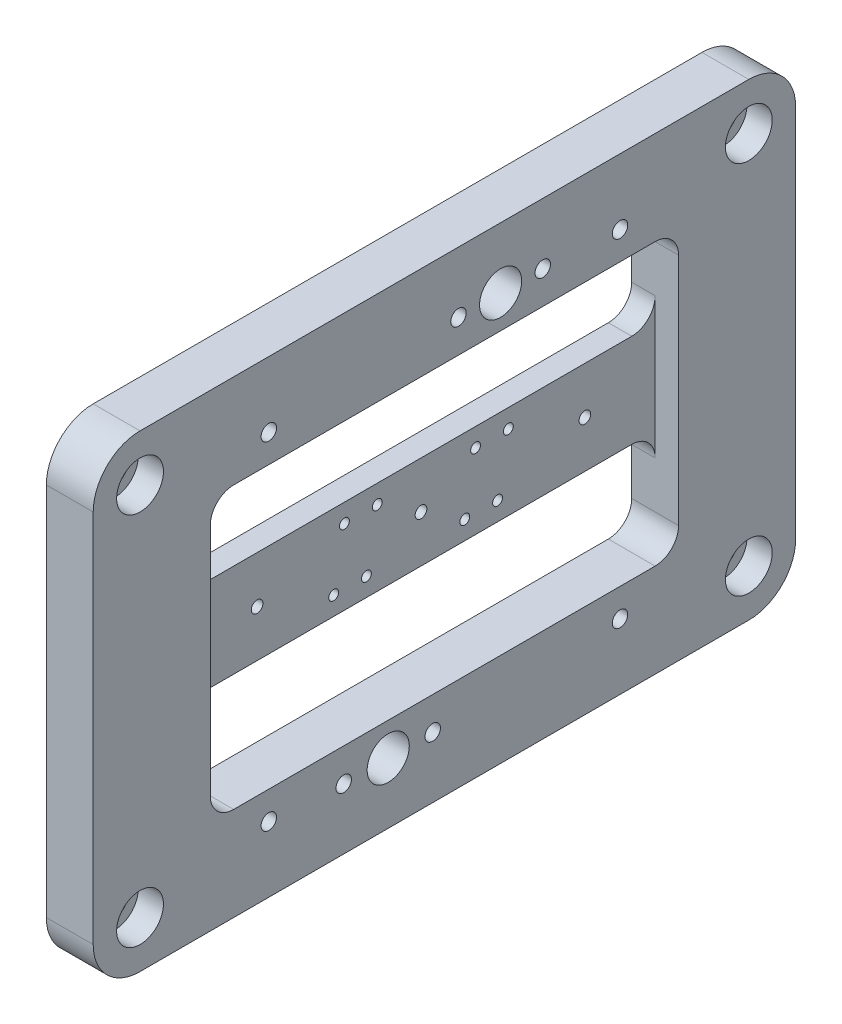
ISO-10303-21;
HEADER;
FILE_DESCRIPTION(('STEP AP214'),'2;1');
FILE_NAME('part.step','',(''),(''),'','','');
FILE_SCHEMA(('AUTOMOTIVE_DESIGN { 1 0 10303 214 1 1 1 1 }'));
ENDSEC;
DATA;
#1=APPLICATION_CONTEXT('core data for automotive mechanical design processes');
#2=APPLICATION_PROTOCOL_DEFINITION('international standard','automotive_design',2000,#1);
#3=PRODUCT_CONTEXT('',#1,'mechanical');
#4=PRODUCT('Part','Part','',(#3));
#5=PRODUCT_RELATED_PRODUCT_CATEGORY('part','',(#4));
#6=PRODUCT_DEFINITION_FORMATION('','',#4);
#7=PRODUCT_DEFINITION_CONTEXT('part definition',#1,'design');
#8=PRODUCT_DEFINITION('design','',#6,#7);
#9=PRODUCT_DEFINITION_SHAPE('','',#8);
#10=(LENGTH_UNIT() NAMED_UNIT(*) SI_UNIT(.MILLI.,.METRE.));
#11=(NAMED_UNIT(*) PLANE_ANGLE_UNIT() SI_UNIT($,.RADIAN.));
#12=(NAMED_UNIT(*) SI_UNIT($,.STERADIAN.) SOLID_ANGLE_UNIT());
#13=UNCERTAINTY_MEASURE_WITH_UNIT(LENGTH_MEASURE(1.E-05),#10,'distance_accuracy_value','');
#14=(GEOMETRIC_REPRESENTATION_CONTEXT(3) GLOBAL_UNCERTAINTY_ASSIGNED_CONTEXT((#13)) GLOBAL_UNIT_ASSIGNED_CONTEXT((#10,
#11,#12)) REPRESENTATION_CONTEXT('',''));
#15=CARTESIAN_POINT('',(0.,0.,0.));
#16=DIRECTION('',(0.,0.,1.));
#17=DIRECTION('',(1.,0.,0.));
#18=AXIS2_PLACEMENT_3D('',#15,#16,#17);
#19=CARTESIAN_POINT('',(10.,-6.02988668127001,-9.34500582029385));
#20=DIRECTION('',(1.,0.,0.));
#21=DIRECTION('',(0.,0.,-1.));
#22=AXIS2_PLACEMENT_3D('',#19,#20,#21);
#23=CYLINDRICAL_SURFACE('',#22,1.05);
#24=CARTESIAN_POINT('',(5.,-6.02988668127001,-9.34500582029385));
#25=DIRECTION('',(1.,0.,0.));
#26=DIRECTION('',(0.,0.,-1.));
#27=AXIS2_PLACEMENT_3D('',#24,#25,#26);
#28=CIRCLE('',#27,1.05);
#29=CARTESIAN_POINT('',(5.,-6.02988668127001,-10.3950058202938));
#30=VERTEX_POINT('',#29);
#31=EDGE_CURVE('E253',#30,#30,#28,.T.);
#32=ORIENTED_EDGE('',*,*,#31,.T.);
#33=EDGE_LOOP('',(#32));
#34=FACE_BOUND('',#33,.T.);
#35=CARTESIAN_POINT('',(2.,-6.02988668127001,-9.34500582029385));
#36=DIRECTION('',(-1.,0.,0.));
#37=DIRECTION('',(0.,0.,1.));
#38=AXIS2_PLACEMENT_3D('',#35,#36,#37);
#39=CIRCLE('',#38,1.05);
#40=CARTESIAN_POINT('',(2.,-6.02988668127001,-8.29500582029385));
#41=VERTEX_POINT('',#40);
#42=EDGE_CURVE('E41',#41,#41,#39,.F.);
#43=ORIENTED_EDGE('',*,*,#42,.F.);
#44=EDGE_LOOP('',(#43));
#45=FACE_BOUND('',#44,.T.);
#46=ADVANCED_FACE('F37',(#34,#45),#23,.F.);
#47=CARTESIAN_POINT('',(10.,6.02988667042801,-11.6549941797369));
#48=DIRECTION('',(1.,0.,0.));
#49=DIRECTION('',(0.,0.,-1.));
#50=AXIS2_PLACEMENT_3D('',#47,#48,#49);
#51=CYLINDRICAL_SURFACE('',#50,1.05);
#52=CARTESIAN_POINT('',(5.,6.02988667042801,-11.6549941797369));
#53=DIRECTION('',(1.,0.,0.));
#54=DIRECTION('',(0.,0.,-1.));
#55=AXIS2_PLACEMENT_3D('',#52,#53,#54);
#56=CIRCLE('',#55,1.05);
#57=CARTESIAN_POINT('',(5.,6.02988667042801,-12.7049941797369));
#58=VERTEX_POINT('',#57);
#59=EDGE_CURVE('E250',#58,#58,#56,.T.);
#60=ORIENTED_EDGE('',*,*,#59,.T.);
#61=EDGE_LOOP('',(#60));
#62=FACE_BOUND('',#61,.T.);
#63=CARTESIAN_POINT('',(2.,6.02988667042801,-11.6549941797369));
#64=DIRECTION('',(-1.,0.,0.));
#65=DIRECTION('',(0.,0.,1.));
#66=AXIS2_PLACEMENT_3D('',#63,#64,#65);
#67=CIRCLE('',#66,1.05);
#68=CARTESIAN_POINT('',(2.,6.02988667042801,-10.604994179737));
#69=VERTEX_POINT('',#68);
#70=EDGE_CURVE('E264',#69,#69,#67,.F.);
#71=ORIENTED_EDGE('',*,*,#70,.F.);
#72=EDGE_LOOP('',(#71));
#73=FACE_BOUND('',#72,.T.);
#74=ADVANCED_FACE('F274',(#62,#73),#51,.F.);
#75=CARTESIAN_POINT('',(10.,-6.02988665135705,-16.3450058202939));
#76=DIRECTION('',(1.,0.,0.));
#77=DIRECTION('',(0.,0.,-1.));
#78=AXIS2_PLACEMENT_3D('',#75,#76,#77);
#79=CYLINDRICAL_SURFACE('',#78,1.05);
#80=CARTESIAN_POINT('',(5.,-6.02988665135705,-16.3450058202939));
#81=DIRECTION('',(1.,0.,0.));
#82=DIRECTION('',(0.,0.,-1.));
#83=AXIS2_PLACEMENT_3D('',#80,#81,#82);
#84=CIRCLE('',#83,1.05);
#85=CARTESIAN_POINT('',(5.,-6.02988665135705,-17.3950058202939));
#86=VERTEX_POINT('',#85);
#87=EDGE_CURVE('E254',#86,#86,#84,.T.);
#88=ORIENTED_EDGE('',*,*,#87,.T.);
#89=EDGE_LOOP('',(#88));
#90=FACE_BOUND('',#89,.T.);
#91=CARTESIAN_POINT('',(2.,-6.02988665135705,-16.3450058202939));
#92=DIRECTION('',(-1.,0.,0.));
#93=DIRECTION('',(0.,0.,1.));
#94=AXIS2_PLACEMENT_3D('',#91,#92,#93);
#95=CIRCLE('',#94,1.05);
#96=CARTESIAN_POINT('',(2.,-6.02988665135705,-15.2950058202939));
#97=VERTEX_POINT('',#96);
#98=EDGE_CURVE('E261',#97,#97,#95,.F.);
#99=ORIENTED_EDGE('',*,*,#98,.F.);
#100=EDGE_LOOP('',(#99));
#101=FACE_BOUND('',#100,.T.);
#102=ADVANCED_FACE('F280',(#90,#101),#79,.F.);
#103=CARTESIAN_POINT('',(10.,6.02988668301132,-18.654994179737));
#104=DIRECTION('',(1.,0.,0.));
#105=DIRECTION('',(0.,0.,-1.));
#106=AXIS2_PLACEMENT_3D('',#103,#104,#105);
#107=CYLINDRICAL_SURFACE('',#106,1.05);
#108=CARTESIAN_POINT('',(5.,6.02988668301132,-18.654994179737));
#109=DIRECTION('',(1.,0.,0.));
#110=DIRECTION('',(0.,0.,-1.));
#111=AXIS2_PLACEMENT_3D('',#108,#109,#110);
#112=CIRCLE('',#111,1.05);
#113=CARTESIAN_POINT('',(5.,6.02988668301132,-19.7049941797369));
#114=VERTEX_POINT('',#113);
#115=EDGE_CURVE('E255',#114,#114,#112,.T.);
#116=ORIENTED_EDGE('',*,*,#115,.T.);
#117=EDGE_LOOP('',(#116));
#118=FACE_BOUND('',#117,.T.);
#119=CARTESIAN_POINT('',(2.,6.02988668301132,-18.654994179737));
#120=DIRECTION('',(-1.,0.,0.));
#121=DIRECTION('',(0.,0.,1.));
#122=AXIS2_PLACEMENT_3D('',#119,#120,#121);
#123=CIRCLE('',#122,1.05);
#124=CARTESIAN_POINT('',(2.,6.02988668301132,-17.604994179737));
#125=VERTEX_POINT('',#124);
#126=EDGE_CURVE('E258',#125,#125,#123,.F.);
#127=ORIENTED_EDGE('',*,*,#126,.F.);
#128=EDGE_LOOP('',(#127));
#129=FACE_BOUND('',#128,.T.);
#130=ADVANCED_FACE('F521',(#118,#129),#107,.F.);
#131=CARTESIAN_POINT('',(0.,40.,-65.));
#132=DIRECTION('',(-1.,0.,0.));
#133=DIRECTION('',(0.,0.,1.));
#134=AXIS2_PLACEMENT_3D('',#131,#132,#133);
#135=PLANE('',#134);
#136=CARTESIAN_POINT('',(0.,-6.02988665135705,-16.3450058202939));
#137=DIRECTION('',(-1.,0.,0.));
#138=DIRECTION('',(0.,0.,1.));
#139=AXIS2_PLACEMENT_3D('',#136,#137,#138);
#140=CIRCLE('',#139,1.59999999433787);
#141=CARTESIAN_POINT('',(0.,-6.02988665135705,-14.745005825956));
#142=VERTEX_POINT('',#141);
#143=EDGE_CURVE('E942',#142,#142,#140,.T.);
#144=ORIENTED_EDGE('',*,*,#143,.F.);
#145=EDGE_LOOP('',(#144));
#146=FACE_BOUND('',#145,.T.);
#147=CARTESIAN_POINT('',(0.,-6.02988668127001,-9.34500582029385));
#148=DIRECTION('',(-1.,0.,0.));
#149=DIRECTION('',(0.,0.,1.));
#150=AXIS2_PLACEMENT_3D('',#147,#148,#149);
#151=CIRCLE('',#150,1.60000000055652);
#152=CARTESIAN_POINT('',(0.,-6.02988668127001,-7.74500581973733));
#153=VERTEX_POINT('',#152);
#154=EDGE_CURVE('E948',#153,#153,#151,.T.);
#155=ORIENTED_EDGE('',*,*,#154,.F.);
#156=EDGE_LOOP('',(#155));
#157=FACE_BOUND('',#156,.T.);
#158=CARTESIAN_POINT('',(0.,6.02988667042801,-11.6549941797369));
#159=DIRECTION('',(-1.,0.,0.));
#160=DIRECTION('',(0.,0.,1.));
#161=AXIS2_PLACEMENT_3D('',#158,#159,#160);
#162=CIRCLE('',#161,1.60000000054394);
#163=CARTESIAN_POINT('',(0.,6.02988667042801,-10.054994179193));
#164=VERTEX_POINT('',#163);
#165=EDGE_CURVE('E954',#164,#164,#162,.T.);
#166=ORIENTED_EDGE('',*,*,#165,.F.);
#167=EDGE_LOOP('',(#166));
#168=FACE_BOUND('',#167,.T.);
#169=CARTESIAN_POINT('',(0.,6.02988668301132,-18.654994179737));
#170=DIRECTION('',(-1.,0.,0.));
#171=DIRECTION('',(0.,0.,1.));
#172=AXIS2_PLACEMENT_3D('',#169,#170,#171);
#173=CIRCLE('',#172,1.59999999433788);
#174=CARTESIAN_POINT('',(0.,6.02988668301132,-17.0549941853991));
#175=VERTEX_POINT('',#174);
#176=EDGE_CURVE('E936',#175,#175,#173,.T.);
#177=ORIENTED_EDGE('',*,*,#176,.F.);
#178=EDGE_LOOP('',(#177));
#179=FACE_BOUND('',#178,.T.);
#180=CARTESIAN_POINT('',(0.,0.,-35.));
#181=DIRECTION('',(-1.,0.,0.));
#182=DIRECTION('',(0.,0.,1.));
#183=AXIS2_PLACEMENT_3D('',#180,#181,#182);
#184=CIRCLE('',#183,1.25);
#185=CARTESIAN_POINT('',(0.,0.,-33.75));
#186=VERTEX_POINT('',#185);
#187=EDGE_CURVE('E930',#186,#186,#184,.T.);
#188=ORIENTED_EDGE('',*,*,#187,.F.);
#189=EDGE_LOOP('',(#188));
#190=FACE_BOUND('',#189,.T.);
#191=CARTESIAN_POINT('',(0.,0.,0.));
#192=DIRECTION('',(-1.,0.,0.));
#193=DIRECTION('',(0.,0.,1.));
#194=AXIS2_PLACEMENT_3D('',#191,#192,#193);
#195=CIRCLE('',#194,1.25);
#196=CARTESIAN_POINT('',(0.,0.,1.25));
#197=VERTEX_POINT('',#196);
#198=EDGE_CURVE('E924',#197,#197,#195,.T.);
#199=ORIENTED_EDGE('',*,*,#198,.F.);
#200=EDGE_LOOP('',(#199));
#201=FACE_BOUND('',#200,.T.);
#202=CARTESIAN_POINT('',(0.,0.,35.));
#203=DIRECTION('',(-1.,0.,0.));
#204=DIRECTION('',(0.,0.,1.));
#205=AXIS2_PLACEMENT_3D('',#202,#203,#204);
#206=CIRCLE('',#205,1.25);
#207=CARTESIAN_POINT('',(0.,0.,36.25));
#208=VERTEX_POINT('',#207);
#209=EDGE_CURVE('E918',#208,#208,#206,.T.);
#210=ORIENTED_EDGE('',*,*,#209,.F.);
#211=EDGE_LOOP('',(#210));
#212=FACE_BOUND('',#211,.T.);
#213=CARTESIAN_POINT('',(0.,-6.02988665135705,11.6549941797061));
#214=DIRECTION('',(-1.,0.,0.));
#215=DIRECTION('',(0.,0.,1.));
#216=AXIS2_PLACEMENT_3D('',#213,#214,#215);
#217=CIRCLE('',#216,1.59999999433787);
#218=CARTESIAN_POINT('',(0.,-6.02988665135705,13.254994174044));
#219=VERTEX_POINT('',#218);
#220=EDGE_CURVE('E898',#219,#219,#217,.T.);
#221=ORIENTED_EDGE('',*,*,#220,.F.);
#222=EDGE_LOOP('',(#221));
#223=FACE_BOUND('',#222,.T.);
#224=CARTESIAN_POINT('',(0.,-6.02988668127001,18.6549941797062));
#225=DIRECTION('',(-1.,0.,0.));
#226=DIRECTION('',(0.,0.,1.));
#227=AXIS2_PLACEMENT_3D('',#224,#225,#226);
#228=CIRCLE('',#227,1.60000000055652);
#229=CARTESIAN_POINT('',(0.,-6.02988668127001,20.2549941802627));
#230=VERTEX_POINT('',#229);
#231=EDGE_CURVE('E905',#230,#230,#228,.T.);
#232=ORIENTED_EDGE('',*,*,#231,.F.);
#233=EDGE_LOOP('',(#232));
#234=FACE_BOUND('',#233,.T.);
#235=CARTESIAN_POINT('',(0.,6.02988667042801,16.3450058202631));
#236=DIRECTION('',(-1.,0.,0.));
#237=DIRECTION('',(0.,0.,1.));
#238=AXIS2_PLACEMENT_3D('',#235,#236,#237);
#239=CIRCLE('',#238,1.60000000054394);
#240=CARTESIAN_POINT('',(0.,6.02988667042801,17.945005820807));
#241=VERTEX_POINT('',#240);
#242=EDGE_CURVE('E911',#241,#241,#239,.T.);
#243=ORIENTED_EDGE('',*,*,#242,.F.);
#244=EDGE_LOOP('',(#243));
#245=FACE_BOUND('',#244,.T.);
#246=CARTESIAN_POINT('',(0.,6.02988668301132,9.34500582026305));
#247=DIRECTION('',(-1.,0.,0.));
#248=DIRECTION('',(0.,0.,1.));
#249=AXIS2_PLACEMENT_3D('',#246,#247,#248);
#250=CIRCLE('',#249,1.59999999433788);
#251=CARTESIAN_POINT('',(0.,6.02988668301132,10.9450058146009));
#252=VERTEX_POINT('',#251);
#253=EDGE_CURVE('E892',#252,#252,#250,.T.);
#254=ORIENTED_EDGE('',*,*,#253,.F.);
#255=EDGE_LOOP('',(#254));
#256=FACE_BOUND('',#255,.T.);
#257=DIRECTION('',(0.,0.,-1.));
#258=VECTOR('',#257,1.);
#259=CARTESIAN_POINT('',(0.,-10.,50.));
#260=LINE('',#259,#258);
#261=CARTESIAN_POINT('',(0.,-10.,45.));
#262=VERTEX_POINT('',#261);
#263=CARTESIAN_POINT('',(0.,-10.,-45.));
#264=VERTEX_POINT('',#263);
#265=EDGE_CURVE('E875',#262,#264,#260,.T.);
#266=ORIENTED_EDGE('',*,*,#265,.F.);
#267=CARTESIAN_POINT('',(0.,-15.,45.));
#268=DIRECTION('',(-1.,0.,0.));
#269=DIRECTION('',(0.,0.,1.));
#270=AXIS2_PLACEMENT_3D('',#267,#268,#269);
#271=CIRCLE('',#270,5.);
#272=CARTESIAN_POINT('',(0.,-15.,50.));
#273=VERTEX_POINT('',#272);
#274=EDGE_CURVE('E46',#262,#273,#271,.F.);
#275=ORIENTED_EDGE('',*,*,#274,.T.);
#276=DIRECTION('',(0.,1.,0.));
#277=VECTOR('',#276,1.);
#278=CARTESIAN_POINT('',(0.,30.,50.));
#279=LINE('',#278,#277);
#280=CARTESIAN_POINT('',(0.,-25.,50.));
#281=VERTEX_POINT('',#280);
#282=EDGE_CURVE('E221',#281,#273,#279,.T.);
#283=ORIENTED_EDGE('',*,*,#282,.F.);
#284=CARTESIAN_POINT('',(0.,-25.,45.));
#285=DIRECTION('',(-1.,0.,0.));
#286=DIRECTION('',(0.,0.,1.));
#287=AXIS2_PLACEMENT_3D('',#284,#285,#286);
#288=CIRCLE('',#287,5.);
#289=CARTESIAN_POINT('',(0.,-30.,45.));
#290=VERTEX_POINT('',#289);
#291=EDGE_CURVE('E624',#281,#290,#288,.F.);
#292=ORIENTED_EDGE('',*,*,#291,.T.);
#293=DIRECTION('',(0.,0.,1.));
#294=VECTOR('',#293,1.);
#295=CARTESIAN_POINT('',(0.,-30.,-50.));
#296=LINE('',#295,#294);
#297=CARTESIAN_POINT('',(0.,-30.,-45.));
#298=VERTEX_POINT('',#297);
#299=EDGE_CURVE('E830',#298,#290,#296,.T.);
#300=ORIENTED_EDGE('',*,*,#299,.F.);
#301=CARTESIAN_POINT('',(0.,-25.,-45.));
#302=DIRECTION('',(-1.,0.,0.));
#303=DIRECTION('',(0.,0.,1.));
#304=AXIS2_PLACEMENT_3D('',#301,#302,#303);
#305=CIRCLE('',#304,5.);
#306=CARTESIAN_POINT('',(0.,-25.,-50.));
#307=VERTEX_POINT('',#306);
#308=EDGE_CURVE('E633',#298,#307,#305,.F.);
#309=ORIENTED_EDGE('',*,*,#308,.T.);
#310=DIRECTION('',(0.,-1.,0.));
#311=VECTOR('',#310,1.);
#312=CARTESIAN_POINT('',(0.,30.,-50.));
#313=LINE('',#312,#311);
#314=CARTESIAN_POINT('',(0.,-15.,-50.));
#315=VERTEX_POINT('',#314);
#316=EDGE_CURVE('E837',#315,#307,#313,.T.);
#317=ORIENTED_EDGE('',*,*,#316,.F.);
#318=CARTESIAN_POINT('',(0.,-15.,-45.));
#319=DIRECTION('',(-1.,0.,0.));
#320=DIRECTION('',(0.,0.,1.));
#321=AXIS2_PLACEMENT_3D('',#318,#319,#320);
#322=CIRCLE('',#321,5.);
#323=EDGE_CURVE('E224',#315,#264,#322,.F.);
#324=ORIENTED_EDGE('',*,*,#323,.T.);
#325=EDGE_LOOP('',(#266,#275,#283,#292,#300,#309,#317,#324));
#326=FACE_BOUND('',#325,.T.);
#327=CARTESIAN_POINT('',(0.,-36.,37.5));
#328=DIRECTION('',(-1.,0.,0.));
#329=DIRECTION('',(0.,0.,1.));
#330=AXIS2_PLACEMENT_3D('',#327,#328,#329);
#331=CIRCLE('',#330,1.65);
#332=CARTESIAN_POINT('',(0.,-36.,39.15));
#333=VERTEX_POINT('',#332);
#334=EDGE_CURVE('E872',#333,#333,#331,.T.);
#335=ORIENTED_EDGE('',*,*,#334,.F.);
#336=EDGE_LOOP('',(#335));
#337=FACE_BOUND('',#336,.T.);
#338=CARTESIAN_POINT('',(0.,36.,37.5));
#339=DIRECTION('',(-1.,0.,0.));
#340=DIRECTION('',(0.,0.,1.));
#341=AXIS2_PLACEMENT_3D('',#338,#339,#340);
#342=CIRCLE('',#341,1.65);
#343=CARTESIAN_POINT('',(0.,36.,39.15));
#344=VERTEX_POINT('',#343);
#345=EDGE_CURVE('E866',#344,#344,#342,.T.);
#346=ORIENTED_EDGE('',*,*,#345,.F.);
#347=EDGE_LOOP('',(#346));
#348=FACE_BOUND('',#347,.T.);
#349=CARTESIAN_POINT('',(0.,36.,-37.5));
#350=DIRECTION('',(-1.,0.,0.));
#351=DIRECTION('',(0.,0.,1.));
#352=AXIS2_PLACEMENT_3D('',#349,#350,#351);
#353=CIRCLE('',#352,1.65);
#354=CARTESIAN_POINT('',(0.,36.,-35.85));
#355=VERTEX_POINT('',#354);
#356=EDGE_CURVE('E860',#355,#355,#353,.T.);
#357=ORIENTED_EDGE('',*,*,#356,.F.);
#358=EDGE_LOOP('',(#357));
#359=FACE_BOUND('',#358,.T.);
#360=CARTESIAN_POINT('',(0.,-36.,-37.5));
#361=DIRECTION('',(-1.,0.,0.));
#362=DIRECTION('',(0.,0.,1.));
#363=AXIS2_PLACEMENT_3D('',#360,#361,#362);
#364=CIRCLE('',#363,1.65);
#365=CARTESIAN_POINT('',(0.,-36.,-35.85));
#366=VERTEX_POINT('',#365);
#367=EDGE_CURVE('E854',#366,#366,#364,.T.);
#368=ORIENTED_EDGE('',*,*,#367,.F.);
#369=EDGE_LOOP('',(#368));
#370=FACE_BOUND('',#369,.T.);
#371=CARTESIAN_POINT('',(0.,15.,50.));
#372=VERTEX_POINT('',#371);
#373=CARTESIAN_POINT('',(0.,25.,50.));
#374=VERTEX_POINT('',#373);
#375=EDGE_CURVE('E842',#372,#374,#279,.T.);
#376=ORIENTED_EDGE('',*,*,#375,.F.);
#377=CARTESIAN_POINT('',(0.,15.,45.));
#378=DIRECTION('',(-1.,0.,0.));
#379=DIRECTION('',(0.,0.,1.));
#380=AXIS2_PLACEMENT_3D('',#377,#378,#379);
#381=CIRCLE('',#380,5.);
#382=CARTESIAN_POINT('',(0.,10.,45.));
#383=VERTEX_POINT('',#382);
#384=EDGE_CURVE('E11',#372,#383,#381,.F.);
#385=ORIENTED_EDGE('',*,*,#384,.T.);
#386=DIRECTION('',(0.,0.,1.));
#387=VECTOR('',#386,1.);
#388=CARTESIAN_POINT('',(0.,10.,50.));
#389=LINE('',#388,#387);
#390=CARTESIAN_POINT('',(0.,10.,-45.));
#391=VERTEX_POINT('',#390);
#392=EDGE_CURVE('E595',#391,#383,#389,.T.);
#393=ORIENTED_EDGE('',*,*,#392,.F.);
#394=CARTESIAN_POINT('',(0.,15.,-45.));
#395=DIRECTION('',(-1.,0.,0.));
#396=DIRECTION('',(0.,0.,1.));
#397=AXIS2_PLACEMENT_3D('',#394,#395,#396);
#398=CIRCLE('',#397,5.);
#399=CARTESIAN_POINT('',(0.,15.,-50.));
#400=VERTEX_POINT('',#399);
#401=EDGE_CURVE('E231',#391,#400,#398,.F.);
#402=ORIENTED_EDGE('',*,*,#401,.T.);
#403=CARTESIAN_POINT('',(0.,25.,-50.));
#404=VERTEX_POINT('',#403);
#405=EDGE_CURVE('E834',#404,#400,#313,.T.);
#406=ORIENTED_EDGE('',*,*,#405,.F.);
#407=CARTESIAN_POINT('',(0.,25.,-45.));
#408=DIRECTION('',(-1.,0.,0.));
#409=DIRECTION('',(0.,0.,1.));
#410=AXIS2_PLACEMENT_3D('',#407,#408,#409);
#411=CIRCLE('',#410,5.);
#412=CARTESIAN_POINT('',(0.,30.,-45.));
#413=VERTEX_POINT('',#412);
#414=EDGE_CURVE('E620',#404,#413,#411,.F.);
#415=ORIENTED_EDGE('',*,*,#414,.T.);
#416=DIRECTION('',(0.,0.,-1.));
#417=VECTOR('',#416,1.);
#418=CARTESIAN_POINT('',(0.,30.,-50.));
#419=LINE('',#418,#417);
#420=CARTESIAN_POINT('',(0.,30.,45.));
#421=VERTEX_POINT('',#420);
#422=EDGE_CURVE('E838',#421,#413,#419,.T.);
#423=ORIENTED_EDGE('',*,*,#422,.F.);
#424=CARTESIAN_POINT('',(0.,25.,45.));
#425=DIRECTION('',(-1.,0.,0.));
#426=DIRECTION('',(0.,0.,1.));
#427=AXIS2_PLACEMENT_3D('',#424,#425,#426);
#428=CIRCLE('',#427,5.);
#429=EDGE_CURVE('E628',#421,#374,#428,.F.);
#430=ORIENTED_EDGE('',*,*,#429,.T.);
#431=EDGE_LOOP('',(#376,#385,#393,#402,#406,#415,#423,#430));
#432=FACE_BOUND('',#431,.T.);
#433=CARTESIAN_POINT('',(0.,37.,-3.));
#434=DIRECTION('',(-1.,0.,0.));
#435=DIRECTION('',(0.,0.,1.));
#436=AXIS2_PLACEMENT_3D('',#433,#434,#435);
#437=CIRCLE('',#436,1.64999999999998);
#438=CARTESIAN_POINT('',(0.,37.,-1.35000000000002));
#439=VERTEX_POINT('',#438);
#440=EDGE_CURVE('E826',#439,#439,#437,.T.);
#441=ORIENTED_EDGE('',*,*,#440,.F.);
#442=EDGE_LOOP('',(#441));
#443=FACE_BOUND('',#442,.T.);
#444=CARTESIAN_POINT('',(0.,-37.,21.5));
#445=DIRECTION('',(-1.,0.,0.));
#446=DIRECTION('',(0.,0.,1.));
#447=AXIS2_PLACEMENT_3D('',#444,#445,#446);
#448=CIRCLE('',#447,1.64999999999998);
#449=CARTESIAN_POINT('',(0.,-37.,23.15));
#450=VERTEX_POINT('',#449);
#451=EDGE_CURVE('E820',#450,#450,#448,.T.);
#452=ORIENTED_EDGE('',*,*,#451,.F.);
#453=EDGE_LOOP('',(#452));
#454=FACE_BOUND('',#453,.T.);
#455=CARTESIAN_POINT('',(0.,-37.,2.5));
#456=DIRECTION('',(-1.,0.,0.));
#457=DIRECTION('',(0.,0.,1.));
#458=AXIS2_PLACEMENT_3D('',#455,#456,#457);
#459=CIRCLE('',#458,1.64999999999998);
#460=CARTESIAN_POINT('',(0.,-37.,4.14999999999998));
#461=VERTEX_POINT('',#460);
#462=EDGE_CURVE('E814',#461,#461,#459,.T.);
#463=ORIENTED_EDGE('',*,*,#462,.F.);
#464=EDGE_LOOP('',(#463));
#465=FACE_BOUND('',#464,.T.);
#466=CARTESIAN_POINT('',(0.,37.,-21.));
#467=DIRECTION('',(-1.,0.,0.));
#468=DIRECTION('',(0.,0.,1.));
#469=AXIS2_PLACEMENT_3D('',#466,#467,#468);
#470=CIRCLE('',#469,1.64999999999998);
#471=CARTESIAN_POINT('',(0.,37.,-19.35));
#472=VERTEX_POINT('',#471);
#473=EDGE_CURVE('E808',#472,#472,#470,.T.);
#474=ORIENTED_EDGE('',*,*,#473,.F.);
#475=EDGE_LOOP('',(#474));
#476=FACE_BOUND('',#475,.T.);
#477=CARTESIAN_POINT('',(0.,40.,65.0000000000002));
#478=DIRECTION('',(-1.,0.,0.));
#479=DIRECTION('',(0.,0.,1.));
#480=AXIS2_PLACEMENT_3D('',#477,#478,#479);
#481=CIRCLE('',#480,4.00000000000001);
#482=CARTESIAN_POINT('',(0.,40.,69.0000000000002));
#483=VERTEX_POINT('',#482);
#484=EDGE_CURVE('E767',#483,#483,#481,.T.);
#485=ORIENTED_EDGE('',*,*,#484,.F.);
#486=EDGE_LOOP('',(#485));
#487=FACE_BOUND('',#486,.T.);
#488=CARTESIAN_POINT('',(0.,-40.,-65.0000000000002));
#489=DIRECTION('',(-1.,0.,0.));
#490=DIRECTION('',(0.,0.,1.));
#491=AXIS2_PLACEMENT_3D('',#488,#489,#490);
#492=CIRCLE('',#491,4.00000000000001);
#493=CARTESIAN_POINT('',(0.,-40.,-61.0000000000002));
#494=VERTEX_POINT('',#493);
#495=EDGE_CURVE('E760',#494,#494,#492,.T.);
#496=ORIENTED_EDGE('',*,*,#495,.F.);
#497=EDGE_LOOP('',(#496));
#498=FACE_BOUND('',#497,.T.);
#499=CARTESIAN_POINT('',(0.,40.,-65.0000000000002));
#500=DIRECTION('',(-1.,0.,0.));
#501=DIRECTION('',(0.,0.,-1.));
#502=AXIS2_PLACEMENT_3D('',#499,#500,#501);
#503=CIRCLE('',#502,4.00000000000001);
#504=CARTESIAN_POINT('',(0.,40.,-69.0000000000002));
#505=VERTEX_POINT('',#504);
#506=EDGE_CURVE('E676',#505,#505,#503,.T.);
#507=ORIENTED_EDGE('',*,*,#506,.F.);
#508=EDGE_LOOP('',(#507));
#509=FACE_BOUND('',#508,.T.);
#510=CARTESIAN_POINT('',(0.,-40.,65.0000000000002));
#511=DIRECTION('',(-1.,0.,0.));
#512=DIRECTION('',(0.,0.,-1.));
#513=AXIS2_PLACEMENT_3D('',#510,#511,#512);
#514=CIRCLE('',#513,4.00000000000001);
#515=CARTESIAN_POINT('',(0.,-40.,61.0000000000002));
#516=VERTEX_POINT('',#515);
#517=EDGE_CURVE('E754',#516,#516,#514,.T.);
#518=ORIENTED_EDGE('',*,*,#517,.F.);
#519=EDGE_LOOP('',(#518));
#520=FACE_BOUND('',#519,.T.);
#521=CARTESIAN_POINT('',(0.,37.,-12.));
#522=DIRECTION('',(-1.,0.,0.));
#523=DIRECTION('',(0.,0.,1.));
#524=AXIS2_PLACEMENT_3D('',#521,#522,#523);
#525=CIRCLE('',#524,6.1);
#526=CARTESIAN_POINT('',(0.,37.,-5.9));
#527=VERTEX_POINT('',#526);
#528=EDGE_CURVE('E744',#527,#527,#525,.T.);
#529=ORIENTED_EDGE('',*,*,#528,.F.);
#530=EDGE_LOOP('',(#529));
#531=FACE_BOUND('',#530,.T.);
#532=CARTESIAN_POINT('',(0.,-37.,12.));
#533=DIRECTION('',(-1.,0.,0.));
#534=DIRECTION('',(0.,0.,1.));
#535=AXIS2_PLACEMENT_3D('',#532,#533,#534);
#536=CIRCLE('',#535,6.1);
#537=CARTESIAN_POINT('',(0.,-37.,18.1));
#538=VERTEX_POINT('',#537);
#539=EDGE_CURVE('E738',#538,#538,#536,.T.);
#540=ORIENTED_EDGE('',*,*,#539,.F.);
#541=EDGE_LOOP('',(#540));
#542=FACE_BOUND('',#541,.T.);
#543=CARTESIAN_POINT('',(0.,40.,-65.));
#544=DIRECTION('',(1.,0.,0.));
#545=DIRECTION('',(0.,0.,1.));
#546=AXIS2_PLACEMENT_3D('',#543,#544,#545);
#547=CIRCLE('',#546,10.);
#548=CARTESIAN_POINT('',(0.,40.,-75.));
#549=VERTEX_POINT('',#548);
#550=CARTESIAN_POINT('',(0.,50.,-65.));
#551=VERTEX_POINT('',#550);
#552=EDGE_CURVE('E717',#549,#551,#547,.T.);
#553=ORIENTED_EDGE('',*,*,#552,.F.);
#554=DIRECTION('',(0.,1.,0.));
#555=VECTOR('',#554,1.);
#556=CARTESIAN_POINT('',(0.,40.,-75.));
#557=LINE('',#556,#555);
#558=CARTESIAN_POINT('',(0.,-40.,-75.));
#559=VERTEX_POINT('',#558);
#560=EDGE_CURVE('E702',#559,#549,#557,.T.);
#561=ORIENTED_EDGE('',*,*,#560,.F.);
#562=CARTESIAN_POINT('',(0.,-40.,-65.));
#563=DIRECTION('',(1.,0.,0.));
#564=DIRECTION('',(0.,0.,-1.));
#565=AXIS2_PLACEMENT_3D('',#562,#563,#564);
#566=CIRCLE('',#565,9.99999999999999);
#567=CARTESIAN_POINT('',(0.,-50.,-65.));
#568=VERTEX_POINT('',#567);
#569=EDGE_CURVE('E705',#568,#559,#566,.T.);
#570=ORIENTED_EDGE('',*,*,#569,.F.);
#571=DIRECTION('',(0.,0.,-1.));
#572=VECTOR('',#571,1.);
#573=CARTESIAN_POINT('',(0.,-50.,65.));
#574=LINE('',#573,#572);
#575=CARTESIAN_POINT('',(0.,-50.,65.));
#576=VERTEX_POINT('',#575);
#577=EDGE_CURVE('E707',#576,#568,#574,.T.);
#578=ORIENTED_EDGE('',*,*,#577,.F.);
#579=CARTESIAN_POINT('',(0.,-40.,65.));
#580=DIRECTION('',(1.,0.,0.));
#581=DIRECTION('',(0.,0.,-1.));
#582=AXIS2_PLACEMENT_3D('',#579,#580,#581);
#583=CIRCLE('',#582,10.);
#584=CARTESIAN_POINT('',(0.,-40.,75.));
#585=VERTEX_POINT('',#584);
#586=EDGE_CURVE('E709',#585,#576,#583,.T.);
#587=ORIENTED_EDGE('',*,*,#586,.F.);
#588=DIRECTION('',(0.,-1.,0.));
#589=VECTOR('',#588,1.);
#590=CARTESIAN_POINT('',(0.,40.,75.));
#591=LINE('',#590,#589);
#592=CARTESIAN_POINT('',(0.,40.,75.));
#593=VERTEX_POINT('',#592);
#594=EDGE_CURVE('E711',#593,#585,#591,.T.);
#595=ORIENTED_EDGE('',*,*,#594,.F.);
#596=CARTESIAN_POINT('',(0.,40.,65.));
#597=DIRECTION('',(1.,0.,0.));
#598=DIRECTION('',(0.,0.,-1.));
#599=AXIS2_PLACEMENT_3D('',#596,#597,#598);
#600=CIRCLE('',#599,10.);
#601=CARTESIAN_POINT('',(0.,50.,65.));
#602=VERTEX_POINT('',#601);
#603=EDGE_CURVE('E713',#602,#593,#600,.T.);
#604=ORIENTED_EDGE('',*,*,#603,.F.);
#605=DIRECTION('',(0.,0.,1.));
#606=VECTOR('',#605,1.);
#607=CARTESIAN_POINT('',(0.,50.,65.));
#608=LINE('',#607,#606);
#609=EDGE_CURVE('E715',#551,#602,#608,.T.);
#610=ORIENTED_EDGE('',*,*,#609,.F.);
#611=EDGE_LOOP('',(#553,#561,#570,#578,#587,#595,#604,#610));
#612=FACE_BOUND('',#611,.T.);
#613=ADVANCED_FACE('F351',(#146,#157,#168,#179,#190,#201,#212,#223,#234,#245,#256,#326,#337,
#348,#359,#370,#432,#443,#454,#465,#476,#487,#498,#509,#520,#531,#542,#612),#135,.T.);
#614=CARTESIAN_POINT('',(10.,-6.02988668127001,18.6549941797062));
#615=DIRECTION('',(1.,0.,0.));
#616=DIRECTION('',(0.,0.,-1.));
#617=AXIS2_PLACEMENT_3D('',#614,#615,#616);
#618=CYLINDRICAL_SURFACE('',#617,1.05);
#619=CARTESIAN_POINT('',(5.,-6.02988668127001,18.6549941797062));
#620=DIRECTION('',(1.,0.,0.));
#621=DIRECTION('',(0.,0.,-1.));
#622=AXIS2_PLACEMENT_3D('',#619,#620,#621);
#623=CIRCLE('',#622,1.05);
#624=CARTESIAN_POINT('',(5.,-6.02988668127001,17.6049941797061));
#625=VERTEX_POINT('',#624);
#626=EDGE_CURVE('E590',#625,#625,#623,.F.);
#627=ORIENTED_EDGE('',*,*,#626,.F.);
#628=EDGE_LOOP('',(#627));
#629=FACE_BOUND('',#628,.T.);
#630=CARTESIAN_POINT('',(2.,-6.02988668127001,18.6549941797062));
#631=DIRECTION('',(-1.,0.,0.));
#632=DIRECTION('',(0.,0.,1.));
#633=AXIS2_PLACEMENT_3D('',#630,#631,#632);
#634=CIRCLE('',#633,1.05);
#635=CARTESIAN_POINT('',(2.,-6.02988668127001,19.7049941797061));
#636=VERTEX_POINT('',#635);
#637=EDGE_CURVE('E205',#636,#636,#634,.F.);
#638=ORIENTED_EDGE('',*,*,#637,.F.);
#639=EDGE_LOOP('',(#638));
#640=FACE_BOUND('',#639,.T.);
#641=ADVANCED_FACE('F347',(#629,#640),#618,.F.);
#642=CARTESIAN_POINT('',(10.,6.02988667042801,16.3450058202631));
#643=DIRECTION('',(1.,0.,0.));
#644=DIRECTION('',(0.,0.,-1.));
#645=AXIS2_PLACEMENT_3D('',#642,#643,#644);
#646=CYLINDRICAL_SURFACE('',#645,1.05);
#647=CARTESIAN_POINT('',(5.,6.02988667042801,16.3450058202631));
#648=DIRECTION('',(1.,0.,0.));
#649=DIRECTION('',(0.,0.,-1.));
#650=AXIS2_PLACEMENT_3D('',#647,#648,#649);
#651=CIRCLE('',#650,1.05);
#652=CARTESIAN_POINT('',(5.,6.02988667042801,15.2950058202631));
#653=VERTEX_POINT('',#652);
#654=EDGE_CURVE('E886',#653,#653,#651,.F.);
#655=ORIENTED_EDGE('',*,*,#654,.F.);
#656=EDGE_LOOP('',(#655));
#657=FACE_BOUND('',#656,.T.);
#658=CARTESIAN_POINT('',(2.,6.02988667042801,16.3450058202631));
#659=DIRECTION('',(-1.,0.,0.));
#660=DIRECTION('',(0.,0.,1.));
#661=AXIS2_PLACEMENT_3D('',#658,#659,#660);
#662=CIRCLE('',#661,1.05);
#663=CARTESIAN_POINT('',(2.,6.02988667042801,17.3950058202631));
#664=VERTEX_POINT('',#663);
#665=EDGE_CURVE('E245',#664,#664,#662,.F.);
#666=ORIENTED_EDGE('',*,*,#665,.F.);
#667=EDGE_LOOP('',(#666));
#668=FACE_BOUND('',#667,.T.);
#669=ADVANCED_FACE('F343',(#657,#668),#646,.F.);
#670=CARTESIAN_POINT('',(10.,-6.02988665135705,11.6549941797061));
#671=DIRECTION('',(1.,0.,0.));
#672=DIRECTION('',(0.,0.,-1.));
#673=AXIS2_PLACEMENT_3D('',#670,#671,#672);
#674=CYLINDRICAL_SURFACE('',#673,1.05);
#675=CARTESIAN_POINT('',(5.,-6.02988665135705,11.6549941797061));
#676=DIRECTION('',(1.,0.,0.));
#677=DIRECTION('',(0.,0.,-1.));
#678=AXIS2_PLACEMENT_3D('',#675,#676,#677);
#679=CIRCLE('',#678,1.05);
#680=CARTESIAN_POINT('',(5.,-6.02988665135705,10.6049941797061));
#681=VERTEX_POINT('',#680);
#682=EDGE_CURVE('E237',#681,#681,#679,.F.);
#683=ORIENTED_EDGE('',*,*,#682,.F.);
#684=EDGE_LOOP('',(#683));
#685=FACE_BOUND('',#684,.T.);
#686=CARTESIAN_POINT('',(2.,-6.02988665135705,11.6549941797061));
#687=DIRECTION('',(-1.,0.,0.));
#688=DIRECTION('',(0.,0.,1.));
#689=AXIS2_PLACEMENT_3D('',#686,#687,#688);
#690=CIRCLE('',#689,1.05);
#691=CARTESIAN_POINT('',(2.,-6.02988665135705,12.7049941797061));
#692=VERTEX_POINT('',#691);
#693=EDGE_CURVE('E241',#692,#692,#690,.F.);
#694=ORIENTED_EDGE('',*,*,#693,.F.);
#695=EDGE_LOOP('',(#694));
#696=FACE_BOUND('',#695,.T.);
#697=ADVANCED_FACE('F339',(#685,#696),#674,.F.);
#698=CARTESIAN_POINT('',(10.,6.02988668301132,9.34500582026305));
#699=DIRECTION('',(1.,0.,0.));
#700=DIRECTION('',(0.,0.,-1.));
#701=AXIS2_PLACEMENT_3D('',#698,#699,#700);
#702=CYLINDRICAL_SURFACE('',#701,1.05);
#703=CARTESIAN_POINT('',(5.,6.02988668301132,9.34500582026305));
#704=DIRECTION('',(1.,0.,0.));
#705=DIRECTION('',(0.,0.,-1.));
#706=AXIS2_PLACEMENT_3D('',#703,#704,#705);
#707=CIRCLE('',#706,1.05);
#708=CARTESIAN_POINT('',(5.,6.02988668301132,8.29500582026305));
#709=VERTEX_POINT('',#708);
#710=EDGE_CURVE('E234',#709,#709,#707,.F.);
#711=ORIENTED_EDGE('',*,*,#710,.F.);
#712=EDGE_LOOP('',(#711));
#713=FACE_BOUND('',#712,.T.);
#714=CARTESIAN_POINT('',(2.,6.02988668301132,9.34500582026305));
#715=DIRECTION('',(-1.,0.,0.));
#716=DIRECTION('',(0.,0.,1.));
#717=AXIS2_PLACEMENT_3D('',#714,#715,#716);
#718=CIRCLE('',#717,1.05);
#719=CARTESIAN_POINT('',(2.,6.02988668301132,10.395005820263));
#720=VERTEX_POINT('',#719);
#721=EDGE_CURVE('E238',#720,#720,#718,.F.);
#722=ORIENTED_EDGE('',*,*,#721,.F.);
#723=EDGE_LOOP('',(#722));
#724=FACE_BOUND('',#723,.T.);
#725=ADVANCED_FACE('F335',(#713,#724),#702,.F.);
#726=CARTESIAN_POINT('',(-101.980390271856,10.,50.));
#727=DIRECTION('',(0.,1.,0.));
#728=DIRECTION('',(0.,0.,1.));
#729=AXIS2_PLACEMENT_3D('',#726,#727,#728);
#730=PLANE('',#729);
#731=DIRECTION('',(1.,0.,0.));
#732=VECTOR('',#731,1.);
#733=CARTESIAN_POINT('',(-101.980390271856,10.,45.));
#734=LINE('',#733,#732);
#735=CARTESIAN_POINT('',(5.,10.,45.));
#736=VERTEX_POINT('',#735);
#737=EDGE_CURVE('E226',#383,#736,#734,.T.);
#738=ORIENTED_EDGE('',*,*,#737,.T.);
#739=DIRECTION('',(0.,0.,-1.));
#740=VECTOR('',#739,1.);
#741=CARTESIAN_POINT('',(5.,10.,50.));
#742=LINE('',#741,#740);
#743=CARTESIAN_POINT('',(5.,10.,-45.));
#744=VERTEX_POINT('',#743);
#745=EDGE_CURVE('E54',#736,#744,#742,.T.);
#746=ORIENTED_EDGE('',*,*,#745,.T.);
#747=DIRECTION('',(1.,0.,0.));
#748=VECTOR('',#747,1.);
#749=CARTESIAN_POINT('',(-101.980390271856,10.,-45.));
#750=LINE('',#749,#748);
#751=EDGE_CURVE('E222',#744,#391,#750,.F.);
#752=ORIENTED_EDGE('',*,*,#751,.T.);
#753=ORIENTED_EDGE('',*,*,#392,.T.);
#754=EDGE_LOOP('',(#738,#746,#752,#753));
#755=FACE_BOUND('',#754,.T.);
#756=ADVANCED_FACE('F338',(#755),#730,.T.);
#757=CARTESIAN_POINT('',(-101.980390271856,-10.,50.));
#758=DIRECTION('',(0.,-1.,0.));
#759=DIRECTION('',(0.,0.,-1.));
#760=AXIS2_PLACEMENT_3D('',#757,#758,#759);
#761=PLANE('',#760);
#762=DIRECTION('',(1.,0.,0.));
#763=VECTOR('',#762,1.);
#764=CARTESIAN_POINT('',(-101.980390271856,-10.,-45.));
#765=LINE('',#764,#763);
#766=CARTESIAN_POINT('',(5.,-10.,-45.));
#767=VERTEX_POINT('',#766);
#768=EDGE_CURVE('E602',#264,#767,#765,.T.);
#769=ORIENTED_EDGE('',*,*,#768,.T.);
#770=DIRECTION('',(0.,0.,1.));
#771=VECTOR('',#770,1.);
#772=CARTESIAN_POINT('',(5.,-10.,50.));
#773=LINE('',#772,#771);
#774=CARTESIAN_POINT('',(5.,-10.,45.));
#775=VERTEX_POINT('',#774);
#776=EDGE_CURVE('E214',#767,#775,#773,.T.);
#777=ORIENTED_EDGE('',*,*,#776,.T.);
#778=DIRECTION('',(1.,0.,0.));
#779=VECTOR('',#778,1.);
#780=CARTESIAN_POINT('',(-101.980390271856,-10.,45.));
#781=LINE('',#780,#779);
#782=EDGE_CURVE('E213',#775,#262,#781,.F.);
#783=ORIENTED_EDGE('',*,*,#782,.T.);
#784=ORIENTED_EDGE('',*,*,#265,.T.);
#785=EDGE_LOOP('',(#769,#777,#783,#784));
#786=FACE_BOUND('',#785,.T.);
#787=ADVANCED_FACE('F353',(#786),#761,.T.);
#788=CARTESIAN_POINT('',(-101.980390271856,-15.,-45.));
#789=DIRECTION('',(1.,0.,0.));
#790=DIRECTION('',(0.,0.,-1.));
#791=AXIS2_PLACEMENT_3D('',#788,#789,#790);
#792=CYLINDRICAL_SURFACE('',#791,5.);
#793=CARTESIAN_POINT('',(5.,-15.,-45.));
#794=DIRECTION('',(1.,0.,0.));
#795=DIRECTION('',(0.,0.,-1.));
#796=AXIS2_PLACEMENT_3D('',#793,#794,#795);
#797=CIRCLE('',#796,5.);
#798=CARTESIAN_POINT('',(5.,-15.,-50.));
#799=VERTEX_POINT('',#798);
#800=EDGE_CURVE('E879',#767,#799,#797,.F.);
#801=ORIENTED_EDGE('',*,*,#800,.F.);
#802=ORIENTED_EDGE('',*,*,#768,.F.);
#803=ORIENTED_EDGE('',*,*,#323,.F.);
#804=DIRECTION('',(1.,0.,0.));
#805=VECTOR('',#804,1.);
#806=CARTESIAN_POINT('',(10.,-15.,-50.));
#807=LINE('',#806,#805);
#808=EDGE_CURVE('E598',#799,#315,#807,.F.);
#809=ORIENTED_EDGE('',*,*,#808,.F.);
#810=EDGE_LOOP('',(#801,#802,#803,#809));
#811=FACE_BOUND('',#810,.T.);
#812=ADVANCED_FACE('F356',(#811),#792,.F.);
#813=CARTESIAN_POINT('',(10.,15.,-45.));
#814=DIRECTION('',(1.,0.,0.));
#815=DIRECTION('',(0.,0.,-1.));
#816=AXIS2_PLACEMENT_3D('',#813,#814,#815);
#817=CYLINDRICAL_SURFACE('',#816,5.);
#818=CARTESIAN_POINT('',(5.,15.,-45.));
#819=DIRECTION('',(1.,0.,0.));
#820=DIRECTION('',(0.,0.,-1.));
#821=AXIS2_PLACEMENT_3D('',#818,#819,#820);
#822=CIRCLE('',#821,5.);
#823=CARTESIAN_POINT('',(5.,15.,-50.));
#824=VERTEX_POINT('',#823);
#825=EDGE_CURVE('E215',#824,#744,#822,.F.);
#826=ORIENTED_EDGE('',*,*,#825,.F.);
#827=DIRECTION('',(1.,0.,0.));
#828=VECTOR('',#827,1.);
#829=CARTESIAN_POINT('',(10.,15.,-50.));
#830=LINE('',#829,#828);
#831=EDGE_CURVE('E596',#400,#824,#830,.T.);
#832=ORIENTED_EDGE('',*,*,#831,.F.);
#833=ORIENTED_EDGE('',*,*,#401,.F.);
#834=ORIENTED_EDGE('',*,*,#751,.F.);
#835=EDGE_LOOP('',(#826,#832,#833,#834));
#836=FACE_BOUND('',#835,.T.);
#837=ADVANCED_FACE('F576',(#836),#817,.F.);
#838=CARTESIAN_POINT('',(10.,-15.,45.));
#839=DIRECTION('',(1.,0.,0.));
#840=DIRECTION('',(0.,0.,-1.));
#841=AXIS2_PLACEMENT_3D('',#838,#839,#840);
#842=CYLINDRICAL_SURFACE('',#841,5.);
#843=CARTESIAN_POINT('',(5.,-15.,45.));
#844=DIRECTION('',(1.,0.,0.));
#845=DIRECTION('',(0.,0.,-1.));
#846=AXIS2_PLACEMENT_3D('',#843,#844,#845);
#847=CIRCLE('',#846,5.);
#848=CARTESIAN_POINT('',(5.,-15.,50.));
#849=VERTEX_POINT('',#848);
#850=EDGE_CURVE('E200',#849,#775,#847,.F.);
#851=ORIENTED_EDGE('',*,*,#850,.F.);
#852=DIRECTION('',(1.,0.,0.));
#853=VECTOR('',#852,1.);
#854=CARTESIAN_POINT('',(10.,-15.,50.));
#855=LINE('',#854,#853);
#856=EDGE_CURVE('E212',#273,#849,#855,.T.);
#857=ORIENTED_EDGE('',*,*,#856,.F.);
#858=ORIENTED_EDGE('',*,*,#274,.F.);
#859=ORIENTED_EDGE('',*,*,#782,.F.);
#860=EDGE_LOOP('',(#851,#857,#858,#859));
#861=FACE_BOUND('',#860,.T.);
#862=ADVANCED_FACE('F210',(#861),#842,.F.);
#863=CARTESIAN_POINT('',(-101.980390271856,15.,45.));
#864=DIRECTION('',(1.,0.,0.));
#865=DIRECTION('',(0.,0.,-1.));
#866=AXIS2_PLACEMENT_3D('',#863,#864,#865);
#867=CYLINDRICAL_SURFACE('',#866,5.);
#868=CARTESIAN_POINT('',(5.,15.,45.));
#869=DIRECTION('',(1.,0.,0.));
#870=DIRECTION('',(0.,0.,-1.));
#871=AXIS2_PLACEMENT_3D('',#868,#869,#870);
#872=CIRCLE('',#871,5.);
#873=CARTESIAN_POINT('',(5.,15.,50.));
#874=VERTEX_POINT('',#873);
#875=EDGE_CURVE('E202',#736,#874,#872,.F.);
#876=ORIENTED_EDGE('',*,*,#875,.F.);
#877=ORIENTED_EDGE('',*,*,#737,.F.);
#878=ORIENTED_EDGE('',*,*,#384,.F.);
#879=DIRECTION('',(1.,0.,0.));
#880=VECTOR('',#879,1.);
#881=CARTESIAN_POINT('',(10.,15.,50.));
#882=LINE('',#881,#880);
#883=EDGE_CURVE('E62',#874,#372,#882,.F.);
#884=ORIENTED_EDGE('',*,*,#883,.F.);
#885=EDGE_LOOP('',(#876,#877,#878,#884));
#886=FACE_BOUND('',#885,.T.);
#887=ADVANCED_FACE('F39',(#886),#867,.F.);
#888=CARTESIAN_POINT('',(10.,40.,-65.));
#889=DIRECTION('',(-1.,0.,0.));
#890=DIRECTION('',(0.,0.,1.));
#891=AXIS2_PLACEMENT_3D('',#888,#889,#890);
#892=CYLINDRICAL_SURFACE('',#891,10.);
#893=ORIENTED_EDGE('',*,*,#552,.T.);
#894=DIRECTION('',(-1.,0.,0.));
#895=VECTOR('',#894,1.);
#896=CARTESIAN_POINT('',(10.,50.,-65.));
#897=LINE('',#896,#895);
#898=CARTESIAN_POINT('',(10.,50.,-65.));
#899=VERTEX_POINT('',#898);
#900=EDGE_CURVE('E657',#899,#551,#897,.T.);
#901=ORIENTED_EDGE('',*,*,#900,.F.);
#902=CARTESIAN_POINT('',(10.,40.,-65.));
#903=DIRECTION('',(1.,0.,0.));
#904=DIRECTION('',(0.,0.,1.));
#905=AXIS2_PLACEMENT_3D('',#902,#903,#904);
#906=CIRCLE('',#905,10.);
#907=CARTESIAN_POINT('',(10.,40.,-75.));
#908=VERTEX_POINT('',#907);
#909=EDGE_CURVE('E704',#908,#899,#906,.T.);
#910=ORIENTED_EDGE('',*,*,#909,.F.);
#911=DIRECTION('',(-1.,0.,0.));
#912=VECTOR('',#911,1.);
#913=CARTESIAN_POINT('',(10.,40.,-75.));
#914=LINE('',#913,#912);
#915=EDGE_CURVE('E698',#908,#549,#914,.T.);
#916=ORIENTED_EDGE('',*,*,#915,.T.);
#917=EDGE_LOOP('',(#893,#901,#910,#916));
#918=FACE_BOUND('',#917,.T.);
#919=ADVANCED_FACE('F549',(#918),#892,.T.);
#920=CARTESIAN_POINT('',(10.,50.,65.));
#921=DIRECTION('',(0.,-1.,0.));
#922=DIRECTION('',(0.,0.,-1.));
#923=AXIS2_PLACEMENT_3D('',#920,#921,#922);
#924=PLANE('',#923);
#925=ORIENTED_EDGE('',*,*,#609,.T.);
#926=DIRECTION('',(-1.,0.,0.));
#927=VECTOR('',#926,1.);
#928=CARTESIAN_POINT('',(10.,50.,65.));
#929=LINE('',#928,#927);
#930=CARTESIAN_POINT('',(10.,50.,65.));
#931=VERTEX_POINT('',#930);
#932=EDGE_CURVE('E680',#931,#602,#929,.T.);
#933=ORIENTED_EDGE('',*,*,#932,.F.);
#934=DIRECTION('',(0.,0.,1.));
#935=VECTOR('',#934,1.);
#936=CARTESIAN_POINT('',(10.,50.,65.));
#937=LINE('',#936,#935);
#938=EDGE_CURVE('E732',#899,#931,#937,.T.);
#939=ORIENTED_EDGE('',*,*,#938,.F.);
#940=ORIENTED_EDGE('',*,*,#900,.T.);
#941=EDGE_LOOP('',(#925,#933,#939,#940));
#942=FACE_BOUND('',#941,.T.);
#943=ADVANCED_FACE('F545',(#942),#924,.F.);
#944=CARTESIAN_POINT('',(10.,40.,65.));
#945=DIRECTION('',(-1.,0.,0.));
#946=DIRECTION('',(0.,0.,1.));
#947=AXIS2_PLACEMENT_3D('',#944,#945,#946);
#948=CYLINDRICAL_SURFACE('',#947,10.);
#949=ORIENTED_EDGE('',*,*,#603,.T.);
#950=DIRECTION('',(-1.,0.,0.));
#951=VECTOR('',#950,1.);
#952=CARTESIAN_POINT('',(10.,40.,75.));
#953=LINE('',#952,#951);
#954=CARTESIAN_POINT('',(10.,40.,75.));
#955=VERTEX_POINT('',#954);
#956=EDGE_CURVE('E683',#955,#593,#953,.T.);
#957=ORIENTED_EDGE('',*,*,#956,.F.);
#958=CARTESIAN_POINT('',(10.,40.,65.));
#959=DIRECTION('',(1.,0.,0.));
#960=DIRECTION('',(0.,0.,-1.));
#961=AXIS2_PLACEMENT_3D('',#958,#959,#960);
#962=CIRCLE('',#961,10.);
#963=EDGE_CURVE('E730',#931,#955,#962,.T.);
#964=ORIENTED_EDGE('',*,*,#963,.F.);
#965=ORIENTED_EDGE('',*,*,#932,.T.);
#966=EDGE_LOOP('',(#949,#957,#964,#965));
#967=FACE_BOUND('',#966,.T.);
#968=ADVANCED_FACE('F541',(#967),#948,.T.);
#969=CARTESIAN_POINT('',(10.,40.,75.));
#970=DIRECTION('',(0.,0.,-1.));
#971=DIRECTION('',(-1.,0.,0.));
#972=AXIS2_PLACEMENT_3D('',#969,#970,#971);
#973=PLANE('',#972);
#974=ORIENTED_EDGE('',*,*,#594,.T.);
#975=DIRECTION('',(-1.,0.,0.));
#976=VECTOR('',#975,1.);
#977=CARTESIAN_POINT('',(10.,-40.,75.));
#978=LINE('',#977,#976);
#979=CARTESIAN_POINT('',(10.,-40.,75.));
#980=VERTEX_POINT('',#979);
#981=EDGE_CURVE('E686',#980,#585,#978,.T.);
#982=ORIENTED_EDGE('',*,*,#981,.F.);
#983=DIRECTION('',(0.,-1.,0.));
#984=VECTOR('',#983,1.);
#985=CARTESIAN_POINT('',(10.,40.,75.));
#986=LINE('',#985,#984);
#987=EDGE_CURVE('E728',#955,#980,#986,.T.);
#988=ORIENTED_EDGE('',*,*,#987,.F.);
#989=ORIENTED_EDGE('',*,*,#956,.T.);
#990=EDGE_LOOP('',(#974,#982,#988,#989));
#991=FACE_BOUND('',#990,.T.);
#992=ADVANCED_FACE('F537',(#991),#973,.F.);
#993=CARTESIAN_POINT('',(10.,-40.,65.));
#994=DIRECTION('',(-1.,0.,0.));
#995=DIRECTION('',(0.,0.,1.));
#996=AXIS2_PLACEMENT_3D('',#993,#994,#995);
#997=CYLINDRICAL_SURFACE('',#996,10.);
#998=ORIENTED_EDGE('',*,*,#586,.T.);
#999=DIRECTION('',(-1.,0.,0.));
#1000=VECTOR('',#999,1.);
#1001=CARTESIAN_POINT('',(10.,-50.,65.));
#1002=LINE('',#1001,#1000);
#1003=CARTESIAN_POINT('',(10.,-50.,65.));
#1004=VERTEX_POINT('',#1003);
#1005=EDGE_CURVE('E689',#1004,#576,#1002,.T.);
#1006=ORIENTED_EDGE('',*,*,#1005,.F.);
#1007=CARTESIAN_POINT('',(10.,-40.,65.));
#1008=DIRECTION('',(1.,0.,0.));
#1009=DIRECTION('',(0.,0.,-1.));
#1010=AXIS2_PLACEMENT_3D('',#1007,#1008,#1009);
#1011=CIRCLE('',#1010,10.);
#1012=EDGE_CURVE('E726',#980,#1004,#1011,.T.);
#1013=ORIENTED_EDGE('',*,*,#1012,.F.);
#1014=ORIENTED_EDGE('',*,*,#981,.T.);
#1015=EDGE_LOOP('',(#998,#1006,#1013,#1014));
#1016=FACE_BOUND('',#1015,.T.);
#1017=ADVANCED_FACE('F533',(#1016),#997,.T.);
#1018=CARTESIAN_POINT('',(10.,-50.,65.));
#1019=DIRECTION('',(0.,1.,0.));
#1020=DIRECTION('',(0.,0.,1.));
#1021=AXIS2_PLACEMENT_3D('',#1018,#1019,#1020);
#1022=PLANE('',#1021);
#1023=ORIENTED_EDGE('',*,*,#577,.T.);
#1024=DIRECTION('',(-1.,0.,0.));
#1025=VECTOR('',#1024,1.);
#1026=CARTESIAN_POINT('',(10.,-50.,-65.));
#1027=LINE('',#1026,#1025);
#1028=CARTESIAN_POINT('',(10.,-50.,-65.));
#1029=VERTEX_POINT('',#1028);
#1030=EDGE_CURVE('E692',#1029,#568,#1027,.T.);
#1031=ORIENTED_EDGE('',*,*,#1030,.F.);
#1032=DIRECTION('',(0.,0.,-1.));
#1033=VECTOR('',#1032,1.);
#1034=CARTESIAN_POINT('',(10.,-50.,65.));
#1035=LINE('',#1034,#1033);
#1036=EDGE_CURVE('E724',#1004,#1029,#1035,.T.);
#1037=ORIENTED_EDGE('',*,*,#1036,.F.);
#1038=ORIENTED_EDGE('',*,*,#1005,.T.);
#1039=EDGE_LOOP('',(#1023,#1031,#1037,#1038));
#1040=FACE_BOUND('',#1039,.T.);
#1041=ADVANCED_FACE('F529',(#1040),#1022,.F.);
#1042=CARTESIAN_POINT('',(10.,-40.,-65.));
#1043=DIRECTION('',(-1.,0.,0.));
#1044=DIRECTION('',(0.,0.,1.));
#1045=AXIS2_PLACEMENT_3D('',#1042,#1043,#1044);
#1046=CYLINDRICAL_SURFACE('',#1045,9.99999999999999);
#1047=ORIENTED_EDGE('',*,*,#569,.T.);
#1048=DIRECTION('',(-1.,0.,0.));
#1049=VECTOR('',#1048,1.);
#1050=CARTESIAN_POINT('',(10.,-40.,-75.));
#1051=LINE('',#1050,#1049);
#1052=CARTESIAN_POINT('',(10.,-40.,-75.));
#1053=VERTEX_POINT('',#1052);
#1054=EDGE_CURVE('E695',#1053,#559,#1051,.T.);
#1055=ORIENTED_EDGE('',*,*,#1054,.F.);
#1056=CARTESIAN_POINT('',(10.,-40.,-65.));
#1057=DIRECTION('',(1.,0.,0.));
#1058=DIRECTION('',(0.,0.,-1.));
#1059=AXIS2_PLACEMENT_3D('',#1056,#1057,#1058);
#1060=CIRCLE('',#1059,9.99999999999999);
#1061=EDGE_CURVE('E722',#1029,#1053,#1060,.T.);
#1062=ORIENTED_EDGE('',*,*,#1061,.F.);
#1063=ORIENTED_EDGE('',*,*,#1030,.T.);
#1064=EDGE_LOOP('',(#1047,#1055,#1062,#1063));
#1065=FACE_BOUND('',#1064,.T.);
#1066=ADVANCED_FACE('F525',(#1065),#1046,.T.);
#1067=CARTESIAN_POINT('',(10.,40.,-75.));
#1068=DIRECTION('',(0.,0.,1.));
#1069=DIRECTION('',(1.,0.,0.));
#1070=AXIS2_PLACEMENT_3D('',#1067,#1068,#1069);
#1071=PLANE('',#1070);
#1072=ORIENTED_EDGE('',*,*,#560,.T.);
#1073=ORIENTED_EDGE('',*,*,#915,.F.);
#1074=DIRECTION('',(0.,1.,0.));
#1075=VECTOR('',#1074,1.);
#1076=CARTESIAN_POINT('',(10.,40.,-75.));
#1077=LINE('',#1076,#1075);
#1078=EDGE_CURVE('E701',#1053,#908,#1077,.T.);
#1079=ORIENTED_EDGE('',*,*,#1078,.F.);
#1080=ORIENTED_EDGE('',*,*,#1054,.T.);
#1081=EDGE_LOOP('',(#1072,#1073,#1079,#1080));
#1082=FACE_BOUND('',#1081,.T.);
#1083=ADVANCED_FACE('F517',(#1082),#1071,.F.);
#1084=CARTESIAN_POINT('',(10.,40.,-65.));
#1085=DIRECTION('',(-1.,0.,0.));
#1086=DIRECTION('',(0.,0.,1.));
#1087=AXIS2_PLACEMENT_3D('',#1084,#1085,#1086);
#1088=PLANE('',#1087);
#1089=CARTESIAN_POINT('',(10.,-36.,37.5));
#1090=DIRECTION('',(-1.,0.,0.));
#1091=DIRECTION('',(0.,0.,1.));
#1092=AXIS2_PLACEMENT_3D('',#1089,#1090,#1091);
#1093=CIRCLE('',#1092,1.65);
#1094=CARTESIAN_POINT('',(10.,-36.,39.15));
#1095=VERTEX_POINT('',#1094);
#1096=EDGE_CURVE('E869',#1095,#1095,#1093,.T.);
#1097=ORIENTED_EDGE('',*,*,#1096,.T.);
#1098=EDGE_LOOP('',(#1097));
#1099=FACE_BOUND('',#1098,.T.);
#1100=CARTESIAN_POINT('',(10.,36.,37.5));
#1101=DIRECTION('',(-1.,0.,0.));
#1102=DIRECTION('',(0.,0.,1.));
#1103=AXIS2_PLACEMENT_3D('',#1100,#1101,#1102);
#1104=CIRCLE('',#1103,1.65);
#1105=CARTESIAN_POINT('',(10.,36.,39.15));
#1106=VERTEX_POINT('',#1105);
#1107=EDGE_CURVE('E863',#1106,#1106,#1104,.T.);
#1108=ORIENTED_EDGE('',*,*,#1107,.T.);
#1109=EDGE_LOOP('',(#1108));
#1110=FACE_BOUND('',#1109,.T.);
#1111=CARTESIAN_POINT('',(10.,36.,-37.5));
#1112=DIRECTION('',(-1.,0.,0.));
#1113=DIRECTION('',(0.,0.,1.));
#1114=AXIS2_PLACEMENT_3D('',#1111,#1112,#1113);
#1115=CIRCLE('',#1114,1.65);
#1116=CARTESIAN_POINT('',(10.,36.,-35.85));
#1117=VERTEX_POINT('',#1116);
#1118=EDGE_CURVE('E857',#1117,#1117,#1115,.T.);
#1119=ORIENTED_EDGE('',*,*,#1118,.T.);
#1120=EDGE_LOOP('',(#1119));
#1121=FACE_BOUND('',#1120,.T.);
#1122=CARTESIAN_POINT('',(10.,-36.,-37.5));
#1123=DIRECTION('',(-1.,0.,0.));
#1124=DIRECTION('',(0.,0.,1.));
#1125=AXIS2_PLACEMENT_3D('',#1122,#1123,#1124);
#1126=CIRCLE('',#1125,1.65);
#1127=CARTESIAN_POINT('',(10.,-36.,-35.85));
#1128=VERTEX_POINT('',#1127);
#1129=EDGE_CURVE('E851',#1128,#1128,#1126,.T.);
#1130=ORIENTED_EDGE('',*,*,#1129,.T.);
#1131=EDGE_LOOP('',(#1130));
#1132=FACE_BOUND('',#1131,.T.);
#1133=DIRECTION('',(0.,1.,0.));
#1134=VECTOR('',#1133,1.);
#1135=CARTESIAN_POINT('',(10.,30.,50.));
#1136=LINE('',#1135,#1134);
#1137=CARTESIAN_POINT('',(10.,-25.,50.));
#1138=VERTEX_POINT('',#1137);
#1139=CARTESIAN_POINT('',(10.,25.,50.));
#1140=VERTEX_POINT('',#1139);
#1141=EDGE_CURVE('E833',#1138,#1140,#1136,.T.);
#1142=ORIENTED_EDGE('',*,*,#1141,.T.);
#1143=CARTESIAN_POINT('',(10.,25.,45.));
#1144=DIRECTION('',(-1.,0.,0.));
#1145=DIRECTION('',(0.,0.,1.));
#1146=AXIS2_PLACEMENT_3D('',#1143,#1144,#1145);
#1147=CIRCLE('',#1146,5.);
#1148=CARTESIAN_POINT('',(10.,30.,45.));
#1149=VERTEX_POINT('',#1148);
#1150=EDGE_CURVE('E626',#1140,#1149,#1147,.T.);
#1151=ORIENTED_EDGE('',*,*,#1150,.T.);
#1152=DIRECTION('',(0.,0.,-1.));
#1153=VECTOR('',#1152,1.);
#1154=CARTESIAN_POINT('',(10.,30.,-50.));
#1155=LINE('',#1154,#1153);
#1156=CARTESIAN_POINT('',(10.,30.,-45.));
#1157=VERTEX_POINT('',#1156);
#1158=EDGE_CURVE('E847',#1149,#1157,#1155,.T.);
#1159=ORIENTED_EDGE('',*,*,#1158,.T.);
#1160=CARTESIAN_POINT('',(10.,25.,-45.));
#1161=DIRECTION('',(-1.,0.,0.));
#1162=DIRECTION('',(0.,0.,1.));
#1163=AXIS2_PLACEMENT_3D('',#1160,#1161,#1162);
#1164=CIRCLE('',#1163,5.);
#1165=CARTESIAN_POINT('',(10.,25.,-50.));
#1166=VERTEX_POINT('',#1165);
#1167=EDGE_CURVE('E618',#1157,#1166,#1164,.T.);
#1168=ORIENTED_EDGE('',*,*,#1167,.T.);
#1169=DIRECTION('',(0.,-1.,0.));
#1170=VECTOR('',#1169,1.);
#1171=CARTESIAN_POINT('',(10.,30.,-50.));
#1172=LINE('',#1171,#1170);
#1173=CARTESIAN_POINT('',(10.,-25.,-50.));
#1174=VERTEX_POINT('',#1173);
#1175=EDGE_CURVE('E845',#1166,#1174,#1172,.T.);
#1176=ORIENTED_EDGE('',*,*,#1175,.T.);
#1177=CARTESIAN_POINT('',(10.,-25.,-45.));
#1178=DIRECTION('',(-1.,0.,0.));
#1179=DIRECTION('',(0.,0.,1.));
#1180=AXIS2_PLACEMENT_3D('',#1177,#1178,#1179);
#1181=CIRCLE('',#1180,5.);
#1182=CARTESIAN_POINT('',(10.,-30.,-45.));
#1183=VERTEX_POINT('',#1182);
#1184=EDGE_CURVE('E631',#1174,#1183,#1181,.T.);
#1185=ORIENTED_EDGE('',*,*,#1184,.T.);
#1186=DIRECTION('',(0.,0.,1.));
#1187=VECTOR('',#1186,1.);
#1188=CARTESIAN_POINT('',(10.,-30.,-50.));
#1189=LINE('',#1188,#1187);
#1190=CARTESIAN_POINT('',(10.,-30.,45.));
#1191=VERTEX_POINT('',#1190);
#1192=EDGE_CURVE('E829',#1183,#1191,#1189,.T.);
#1193=ORIENTED_EDGE('',*,*,#1192,.T.);
#1194=CARTESIAN_POINT('',(10.,-25.,45.));
#1195=DIRECTION('',(-1.,0.,0.));
#1196=DIRECTION('',(0.,0.,1.));
#1197=AXIS2_PLACEMENT_3D('',#1194,#1195,#1196);
#1198=CIRCLE('',#1197,5.);
#1199=EDGE_CURVE('E622',#1191,#1138,#1198,.T.);
#1200=ORIENTED_EDGE('',*,*,#1199,.T.);
#1201=EDGE_LOOP('',(#1142,#1151,#1159,#1168,#1176,#1185,#1193,#1200));
#1202=FACE_BOUND('',#1201,.T.);
#1203=CARTESIAN_POINT('',(10.,37.,-3.));
#1204=DIRECTION('',(-1.,0.,0.));
#1205=DIRECTION('',(0.,0.,1.));
#1206=AXIS2_PLACEMENT_3D('',#1203,#1204,#1205);
#1207=CIRCLE('',#1206,1.65);
#1208=CARTESIAN_POINT('',(10.,37.,-1.35));
#1209=VERTEX_POINT('',#1208);
#1210=EDGE_CURVE('E823',#1209,#1209,#1207,.T.);
#1211=ORIENTED_EDGE('',*,*,#1210,.T.);
#1212=EDGE_LOOP('',(#1211));
#1213=FACE_BOUND('',#1212,.T.);
#1214=CARTESIAN_POINT('',(10.,-37.,21.5));
#1215=DIRECTION('',(-1.,0.,0.));
#1216=DIRECTION('',(0.,0.,1.));
#1217=AXIS2_PLACEMENT_3D('',#1214,#1215,#1216);
#1218=CIRCLE('',#1217,1.65);
#1219=CARTESIAN_POINT('',(10.,-37.,23.15));
#1220=VERTEX_POINT('',#1219);
#1221=EDGE_CURVE('E817',#1220,#1220,#1218,.T.);
#1222=ORIENTED_EDGE('',*,*,#1221,.T.);
#1223=EDGE_LOOP('',(#1222));
#1224=FACE_BOUND('',#1223,.T.);
#1225=CARTESIAN_POINT('',(10.,-37.,2.5));
#1226=DIRECTION('',(-1.,0.,0.));
#1227=DIRECTION('',(0.,0.,1.));
#1228=AXIS2_PLACEMENT_3D('',#1225,#1226,#1227);
#1229=CIRCLE('',#1228,1.65);
#1230=CARTESIAN_POINT('',(10.,-37.,4.14999999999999));
#1231=VERTEX_POINT('',#1230);
#1232=EDGE_CURVE('E811',#1231,#1231,#1229,.T.);
#1233=ORIENTED_EDGE('',*,*,#1232,.T.);
#1234=EDGE_LOOP('',(#1233));
#1235=FACE_BOUND('',#1234,.T.);
#1236=CARTESIAN_POINT('',(10.,37.,-21.));
#1237=DIRECTION('',(-1.,0.,0.));
#1238=DIRECTION('',(0.,0.,1.));
#1239=AXIS2_PLACEMENT_3D('',#1236,#1237,#1238);
#1240=CIRCLE('',#1239,1.65);
#1241=CARTESIAN_POINT('',(10.,37.,-19.35));
#1242=VERTEX_POINT('',#1241);
#1243=EDGE_CURVE('E805',#1242,#1242,#1240,.T.);
#1244=ORIENTED_EDGE('',*,*,#1243,.T.);
#1245=EDGE_LOOP('',(#1244));
#1246=FACE_BOUND('',#1245,.T.);
#1247=CARTESIAN_POINT('',(10.,40.,65.0000000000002));
#1248=DIRECTION('',(1.,0.,0.));
#1249=DIRECTION('',(0.,0.,-1.));
#1250=AXIS2_PLACEMENT_3D('',#1247,#1248,#1249);
#1251=CIRCLE('',#1250,5.);
#1252=CARTESIAN_POINT('',(10.,40.,60.0000000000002));
#1253=VERTEX_POINT('',#1252);
#1254=EDGE_CURVE('E802',#1253,#1253,#1251,.T.);
#1255=ORIENTED_EDGE('',*,*,#1254,.F.);
#1256=EDGE_LOOP('',(#1255));
#1257=FACE_BOUND('',#1256,.T.);
#1258=CARTESIAN_POINT('',(10.,40.,-65.0000000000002));
#1259=DIRECTION('',(1.,0.,0.));
#1260=DIRECTION('',(0.,0.,-1.));
#1261=AXIS2_PLACEMENT_3D('',#1258,#1259,#1260);
#1262=CIRCLE('',#1261,5.);
#1263=CARTESIAN_POINT('',(10.,40.,-70.0000000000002));
#1264=VERTEX_POINT('',#1263);
#1265=EDGE_CURVE('E661',#1264,#1264,#1262,.T.);
#1266=ORIENTED_EDGE('',*,*,#1265,.F.);
#1267=EDGE_LOOP('',(#1266));
#1268=FACE_BOUND('',#1267,.T.);
#1269=CARTESIAN_POINT('',(10.,-40.,-65.0000000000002));
#1270=DIRECTION('',(1.,0.,0.));
#1271=DIRECTION('',(0.,0.,-1.));
#1272=AXIS2_PLACEMENT_3D('',#1269,#1270,#1271);
#1273=CIRCLE('',#1272,5.);
#1274=CARTESIAN_POINT('',(10.,-40.,-70.0000000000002));
#1275=VERTEX_POINT('',#1274);
#1276=EDGE_CURVE('E666',#1275,#1275,#1273,.T.);
#1277=ORIENTED_EDGE('',*,*,#1276,.F.);
#1278=EDGE_LOOP('',(#1277));
#1279=FACE_BOUND('',#1278,.T.);
#1280=CARTESIAN_POINT('',(10.,-40.,65.0000000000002));
#1281=DIRECTION('',(1.,0.,0.));
#1282=DIRECTION('',(0.,0.,-1.));
#1283=AXIS2_PLACEMENT_3D('',#1280,#1281,#1282);
#1284=CIRCLE('',#1283,5.);
#1285=CARTESIAN_POINT('',(10.,-40.,60.0000000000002));
#1286=VERTEX_POINT('',#1285);
#1287=EDGE_CURVE('E671',#1286,#1286,#1284,.T.);
#1288=ORIENTED_EDGE('',*,*,#1287,.F.);
#1289=EDGE_LOOP('',(#1288));
#1290=FACE_BOUND('',#1289,.T.);
#1291=CARTESIAN_POINT('',(10.,-37.,12.));
#1292=DIRECTION('',(1.,0.,0.));
#1293=DIRECTION('',(0.,0.,-1.));
#1294=AXIS2_PLACEMENT_3D('',#1291,#1292,#1293);
#1295=CIRCLE('',#1294,4.5);
#1296=CARTESIAN_POINT('',(10.,-37.,7.5));
#1297=VERTEX_POINT('',#1296);
#1298=EDGE_CURVE('E750',#1297,#1297,#1295,.T.);
#1299=ORIENTED_EDGE('',*,*,#1298,.F.);
#1300=EDGE_LOOP('',(#1299));
#1301=FACE_BOUND('',#1300,.T.);
#1302=CARTESIAN_POINT('',(10.,37.,-12.));
#1303=DIRECTION('',(1.,0.,0.));
#1304=DIRECTION('',(0.,0.,-1.));
#1305=AXIS2_PLACEMENT_3D('',#1302,#1303,#1304);
#1306=CIRCLE('',#1305,4.5);
#1307=CARTESIAN_POINT('',(10.,37.,-16.5));
#1308=VERTEX_POINT('',#1307);
#1309=EDGE_CURVE('E747',#1308,#1308,#1306,.T.);
#1310=ORIENTED_EDGE('',*,*,#1309,.F.);
#1311=EDGE_LOOP('',(#1310));
#1312=FACE_BOUND('',#1311,.T.);
#1313=ORIENTED_EDGE('',*,*,#909,.T.);
#1314=ORIENTED_EDGE('',*,*,#938,.T.);
#1315=ORIENTED_EDGE('',*,*,#963,.T.);
#1316=ORIENTED_EDGE('',*,*,#987,.T.);
#1317=ORIENTED_EDGE('',*,*,#1012,.T.);
#1318=ORIENTED_EDGE('',*,*,#1036,.T.);
#1319=ORIENTED_EDGE('',*,*,#1061,.T.);
#1320=ORIENTED_EDGE('',*,*,#1078,.T.);
#1321=EDGE_LOOP('',(#1313,#1314,#1315,#1316,#1317,#1318,#1319,#1320));
#1322=FACE_BOUND('',#1321,.T.);
#1323=ADVANCED_FACE('F513',(#1099,#1110,#1121,#1132,#1202,#1213,#1224,#1235,#1246,#1257,#1268,
#1279,#1290,#1301,#1312,#1322),#1088,.F.);
#1324=CARTESIAN_POINT('',(2.9,-37.,12.));
#1325=DIRECTION('',(1.,0.,0.));
#1326=DIRECTION('',(0.,0.,-1.));
#1327=AXIS2_PLACEMENT_3D('',#1324,#1325,#1326);
#1328=PLANE('',#1327);
#1329=CARTESIAN_POINT('',(2.9,-37.,12.));
#1330=DIRECTION('',(1.,0.,0.));
#1331=DIRECTION('',(0.,0.,-1.));
#1332=AXIS2_PLACEMENT_3D('',#1329,#1330,#1331);
#1333=CIRCLE('',#1332,5.);
#1334=CARTESIAN_POINT('',(2.9,-37.,7.));
#1335=VERTEX_POINT('',#1334);
#1336=EDGE_CURVE('E609',#1335,#1335,#1333,.T.);
#1337=ORIENTED_EDGE('',*,*,#1336,.T.);
#1338=EDGE_LOOP('',(#1337));
#1339=FACE_BOUND('',#1338,.T.);
#1340=CARTESIAN_POINT('',(2.9,-37.,12.));
#1341=DIRECTION('',(-1.,0.,0.));
#1342=DIRECTION('',(0.,0.,1.));
#1343=AXIS2_PLACEMENT_3D('',#1340,#1341,#1342);
#1344=CIRCLE('',#1343,6.1);
#1345=CARTESIAN_POINT('',(2.9,-37.,18.1));
#1346=VERTEX_POINT('',#1345);
#1347=EDGE_CURVE('E720',#1346,#1346,#1344,.T.);
#1348=ORIENTED_EDGE('',*,*,#1347,.T.);
#1349=EDGE_LOOP('',(#1348));
#1350=FACE_BOUND('',#1349,.T.);
#1351=ADVANCED_FACE('F509',(#1339,#1350),#1328,.F.);
#1352=CARTESIAN_POINT('',(0.,-37.,12.));
#1353=DIRECTION('',(-1.,0.,0.));
#1354=DIRECTION('',(0.,0.,1.));
#1355=AXIS2_PLACEMENT_3D('',#1352,#1353,#1354);
#1356=CYLINDRICAL_SURFACE('',#1355,6.1);
#1357=ORIENTED_EDGE('',*,*,#1347,.F.);
#1358=EDGE_LOOP('',(#1357));
#1359=FACE_BOUND('',#1358,.T.);
#1360=ORIENTED_EDGE('',*,*,#539,.T.);
#1361=EDGE_LOOP('',(#1360));
#1362=FACE_BOUND('',#1361,.T.);
#1363=ADVANCED_FACE('F505',(#1359,#1362),#1356,.F.);
#1364=CARTESIAN_POINT('',(2.9,37.,-12.));
#1365=DIRECTION('',(1.,0.,0.));
#1366=DIRECTION('',(0.,0.,-1.));
#1367=AXIS2_PLACEMENT_3D('',#1364,#1365,#1366);
#1368=PLANE('',#1367);
#1369=CARTESIAN_POINT('',(2.9,37.,-12.));
#1370=DIRECTION('',(1.,0.,0.));
#1371=DIRECTION('',(0.,0.,-1.));
#1372=AXIS2_PLACEMENT_3D('',#1369,#1370,#1371);
#1373=CIRCLE('',#1372,5.);
#1374=CARTESIAN_POINT('',(2.9,37.,-17.));
#1375=VERTEX_POINT('',#1374);
#1376=EDGE_CURVE('E615',#1375,#1375,#1373,.T.);
#1377=ORIENTED_EDGE('',*,*,#1376,.T.);
#1378=EDGE_LOOP('',(#1377));
#1379=FACE_BOUND('',#1378,.T.);
#1380=CARTESIAN_POINT('',(2.9,37.,-12.));
#1381=DIRECTION('',(-1.,0.,0.));
#1382=DIRECTION('',(0.,0.,1.));
#1383=AXIS2_PLACEMENT_3D('',#1380,#1381,#1382);
#1384=CIRCLE('',#1383,6.1);
#1385=CARTESIAN_POINT('',(2.9,37.,-5.9));
#1386=VERTEX_POINT('',#1385);
#1387=EDGE_CURVE('E741',#1386,#1386,#1384,.T.);
#1388=ORIENTED_EDGE('',*,*,#1387,.T.);
#1389=EDGE_LOOP('',(#1388));
#1390=FACE_BOUND('',#1389,.T.);
#1391=ADVANCED_FACE('F501',(#1379,#1390),#1368,.F.);
#1392=CARTESIAN_POINT('',(0.,37.,-12.));
#1393=DIRECTION('',(-1.,0.,0.));
#1394=DIRECTION('',(0.,0.,1.));
#1395=AXIS2_PLACEMENT_3D('',#1392,#1393,#1394);
#1396=CYLINDRICAL_SURFACE('',#1395,6.1);
#1397=ORIENTED_EDGE('',*,*,#1387,.F.);
#1398=EDGE_LOOP('',(#1397));
#1399=FACE_BOUND('',#1398,.T.);
#1400=ORIENTED_EDGE('',*,*,#528,.T.);
#1401=EDGE_LOOP('',(#1400));
#1402=FACE_BOUND('',#1401,.T.);
#1403=ADVANCED_FACE('F497',(#1399,#1402),#1396,.F.);
#1404=CARTESIAN_POINT('',(10.,37.,-12.));
#1405=DIRECTION('',(1.,0.,0.));
#1406=DIRECTION('',(0.,0.,-1.));
#1407=AXIS2_PLACEMENT_3D('',#1404,#1405,#1406);
#1408=CYLINDRICAL_SURFACE('',#1407,4.5);
#1409=CARTESIAN_POINT('',(3.4,37.,-12.));
#1410=DIRECTION('',(1.,0.,0.));
#1411=DIRECTION('',(0.,0.,-1.));
#1412=AXIS2_PLACEMENT_3D('',#1409,#1410,#1411);
#1413=CIRCLE('',#1412,4.5);
#1414=CARTESIAN_POINT('',(3.4,37.,-16.5));
#1415=VERTEX_POINT('',#1414);
#1416=EDGE_CURVE('E612',#1415,#1415,#1413,.F.);
#1417=ORIENTED_EDGE('',*,*,#1416,.T.);
#1418=EDGE_LOOP('',(#1417));
#1419=FACE_BOUND('',#1418,.T.);
#1420=ORIENTED_EDGE('',*,*,#1309,.T.);
#1421=EDGE_LOOP('',(#1420));
#1422=FACE_BOUND('',#1421,.T.);
#1423=ADVANCED_FACE('F493',(#1419,#1422),#1408,.F.);
#1424=CARTESIAN_POINT('',(10.,-37.,12.));
#1425=DIRECTION('',(1.,0.,0.));
#1426=DIRECTION('',(0.,0.,-1.));
#1427=AXIS2_PLACEMENT_3D('',#1424,#1425,#1426);
#1428=CYLINDRICAL_SURFACE('',#1427,4.5);
#1429=CARTESIAN_POINT('',(3.4,-37.,12.));
#1430=DIRECTION('',(1.,0.,0.));
#1431=DIRECTION('',(0.,0.,-1.));
#1432=AXIS2_PLACEMENT_3D('',#1429,#1430,#1431);
#1433=CIRCLE('',#1432,4.5);
#1434=CARTESIAN_POINT('',(3.4,-37.,7.5));
#1435=VERTEX_POINT('',#1434);
#1436=EDGE_CURVE('E606',#1435,#1435,#1433,.F.);
#1437=ORIENTED_EDGE('',*,*,#1436,.T.);
#1438=EDGE_LOOP('',(#1437));
#1439=FACE_BOUND('',#1438,.T.);
#1440=ORIENTED_EDGE('',*,*,#1298,.T.);
#1441=EDGE_LOOP('',(#1440));
#1442=FACE_BOUND('',#1441,.T.);
#1443=ADVANCED_FACE('F489',(#1439,#1442),#1428,.F.);
#1444=CARTESIAN_POINT('',(2.6,-40.,65.0000000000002));
#1445=DIRECTION('',(-1.,0.,0.));
#1446=DIRECTION('',(0.,0.,1.));
#1447=AXIS2_PLACEMENT_3D('',#1444,#1445,#1446);
#1448=CYLINDRICAL_SURFACE('',#1447,4.00000000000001);
#1449=CARTESIAN_POINT('',(2.6,-40.,65.0000000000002));
#1450=DIRECTION('',(-1.,0.,0.));
#1451=DIRECTION('',(0.,0.,-1.));
#1452=AXIS2_PLACEMENT_3D('',#1449,#1450,#1451);
#1453=CIRCLE('',#1452,4.00000000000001);
#1454=CARTESIAN_POINT('',(2.6,-40.,61.0000000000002));
#1455=VERTEX_POINT('',#1454);
#1456=EDGE_CURVE('E753',#1455,#1455,#1453,.T.);
#1457=ORIENTED_EDGE('',*,*,#1456,.F.);
#1458=EDGE_LOOP('',(#1457));
#1459=FACE_BOUND('',#1458,.T.);
#1460=ORIENTED_EDGE('',*,*,#517,.T.);
#1461=EDGE_LOOP('',(#1460));
#1462=FACE_BOUND('',#1461,.T.);
#1463=ADVANCED_FACE('F485',(#1459,#1462),#1448,.F.);
#1464=CARTESIAN_POINT('',(2.6,-40.,65.0000000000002));
#1465=DIRECTION('',(1.,0.,0.));
#1466=DIRECTION('',(0.,0.,-1.));
#1467=AXIS2_PLACEMENT_3D('',#1464,#1465,#1466);
#1468=PLANE('',#1467);
#1469=CARTESIAN_POINT('',(2.6,-40.,65.0000000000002));
#1470=DIRECTION('',(1.,0.,0.));
#1471=DIRECTION('',(0.,0.,-1.));
#1472=AXIS2_PLACEMENT_3D('',#1469,#1470,#1471);
#1473=CIRCLE('',#1472,2.75);
#1474=CARTESIAN_POINT('',(2.6,-40.,62.2500000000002));
#1475=VERTEX_POINT('',#1474);
#1476=EDGE_CURVE('E673',#1475,#1475,#1473,.T.);
#1477=ORIENTED_EDGE('',*,*,#1476,.T.);
#1478=EDGE_LOOP('',(#1477));
#1479=FACE_BOUND('',#1478,.T.);
#1480=ORIENTED_EDGE('',*,*,#1456,.T.);
#1481=EDGE_LOOP('',(#1480));
#1482=FACE_BOUND('',#1481,.T.);
#1483=ADVANCED_FACE('F467',(#1479,#1482),#1468,.F.);
#1484=CARTESIAN_POINT('',(2.6,40.,-65.0000000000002));
#1485=DIRECTION('',(-1.,0.,0.));
#1486=DIRECTION('',(0.,0.,1.));
#1487=AXIS2_PLACEMENT_3D('',#1484,#1485,#1486);
#1488=CYLINDRICAL_SURFACE('',#1487,4.00000000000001);
#1489=CARTESIAN_POINT('',(2.6,40.,-65.0000000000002));
#1490=DIRECTION('',(-1.,0.,0.));
#1491=DIRECTION('',(0.,0.,-1.));
#1492=AXIS2_PLACEMENT_3D('',#1489,#1490,#1491);
#1493=CIRCLE('',#1492,4.00000000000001);
#1494=CARTESIAN_POINT('',(2.6,40.,-69.0000000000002));
#1495=VERTEX_POINT('',#1494);
#1496=EDGE_CURVE('E764',#1495,#1495,#1493,.T.);
#1497=ORIENTED_EDGE('',*,*,#1496,.F.);
#1498=EDGE_LOOP('',(#1497));
#1499=FACE_BOUND('',#1498,.T.);
#1500=ORIENTED_EDGE('',*,*,#506,.T.);
#1501=EDGE_LOOP('',(#1500));
#1502=FACE_BOUND('',#1501,.T.);
#1503=ADVANCED_FACE('F463',(#1499,#1502),#1488,.F.);
#1504=CARTESIAN_POINT('',(2.6,40.,-65.0000000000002));
#1505=DIRECTION('',(1.,0.,0.));
#1506=DIRECTION('',(0.,0.,-1.));
#1507=AXIS2_PLACEMENT_3D('',#1504,#1505,#1506);
#1508=PLANE('',#1507);
#1509=CARTESIAN_POINT('',(2.6,40.,-65.0000000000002));
#1510=DIRECTION('',(1.,0.,0.));
#1511=DIRECTION('',(0.,0.,-1.));
#1512=AXIS2_PLACEMENT_3D('',#1509,#1510,#1511);
#1513=CIRCLE('',#1512,2.75);
#1514=CARTESIAN_POINT('',(2.6,40.,-67.7500000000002));
#1515=VERTEX_POINT('',#1514);
#1516=EDGE_CURVE('E663',#1515,#1515,#1513,.T.);
#1517=ORIENTED_EDGE('',*,*,#1516,.T.);
#1518=EDGE_LOOP('',(#1517));
#1519=FACE_BOUND('',#1518,.T.);
#1520=ORIENTED_EDGE('',*,*,#1496,.T.);
#1521=EDGE_LOOP('',(#1520));
#1522=FACE_BOUND('',#1521,.T.);
#1523=ADVANCED_FACE('F459',(#1519,#1522),#1508,.F.);
#1524=CARTESIAN_POINT('',(2.6,-40.,-65.0000000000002));
#1525=DIRECTION('',(-1.,0.,0.));
#1526=DIRECTION('',(0.,0.,1.));
#1527=AXIS2_PLACEMENT_3D('',#1524,#1525,#1526);
#1528=CYLINDRICAL_SURFACE('',#1527,4.00000000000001);
#1529=CARTESIAN_POINT('',(2.6,-40.,-65.0000000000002));
#1530=DIRECTION('',(-1.,0.,0.));
#1531=DIRECTION('',(0.,0.,1.));
#1532=AXIS2_PLACEMENT_3D('',#1529,#1530,#1531);
#1533=CIRCLE('',#1532,4.00000000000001);
#1534=CARTESIAN_POINT('',(2.6,-40.,-61.0000000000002));
#1535=VERTEX_POINT('',#1534);
#1536=EDGE_CURVE('E763',#1535,#1535,#1533,.T.);
#1537=ORIENTED_EDGE('',*,*,#1536,.F.);
#1538=EDGE_LOOP('',(#1537));
#1539=FACE_BOUND('',#1538,.T.);
#1540=ORIENTED_EDGE('',*,*,#495,.T.);
#1541=EDGE_LOOP('',(#1540));
#1542=FACE_BOUND('',#1541,.T.);
#1543=ADVANCED_FACE('F462',(#1539,#1542),#1528,.F.);
#1544=CARTESIAN_POINT('',(2.6,-40.,-65.0000000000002));
#1545=DIRECTION('',(-1.,0.,0.));
#1546=DIRECTION('',(0.,0.,1.));
#1547=AXIS2_PLACEMENT_3D('',#1544,#1545,#1546);
#1548=PLANE('',#1547);
#1549=CARTESIAN_POINT('',(2.6,-40.,-65.0000000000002));
#1550=DIRECTION('',(-1.,0.,0.));
#1551=DIRECTION('',(0.,0.,1.));
#1552=AXIS2_PLACEMENT_3D('',#1549,#1550,#1551);
#1553=CIRCLE('',#1552,2.75);
#1554=CARTESIAN_POINT('',(2.6,-40.,-62.2500000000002));
#1555=VERTEX_POINT('',#1554);
#1556=EDGE_CURVE('E668',#1555,#1555,#1553,.T.);
#1557=ORIENTED_EDGE('',*,*,#1556,.F.);
#1558=EDGE_LOOP('',(#1557));
#1559=FACE_BOUND('',#1558,.T.);
#1560=ORIENTED_EDGE('',*,*,#1536,.T.);
#1561=EDGE_LOOP('',(#1560));
#1562=FACE_BOUND('',#1561,.T.);
#1563=ADVANCED_FACE('F475',(#1559,#1562),#1548,.T.);
#1564=CARTESIAN_POINT('',(2.6,40.,65.0000000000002));
#1565=DIRECTION('',(-1.,0.,0.));
#1566=DIRECTION('',(0.,0.,1.));
#1567=AXIS2_PLACEMENT_3D('',#1564,#1565,#1566);
#1568=CYLINDRICAL_SURFACE('',#1567,4.00000000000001);
#1569=CARTESIAN_POINT('',(2.6,40.,65.0000000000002));
#1570=DIRECTION('',(-1.,0.,0.));
#1571=DIRECTION('',(0.,0.,1.));
#1572=AXIS2_PLACEMENT_3D('',#1569,#1570,#1571);
#1573=CIRCLE('',#1572,4.00000000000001);
#1574=CARTESIAN_POINT('',(2.6,40.,69.0000000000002));
#1575=VERTEX_POINT('',#1574);
#1576=EDGE_CURVE('E757',#1575,#1575,#1573,.T.);
#1577=ORIENTED_EDGE('',*,*,#1576,.F.);
#1578=EDGE_LOOP('',(#1577));
#1579=FACE_BOUND('',#1578,.T.);
#1580=ORIENTED_EDGE('',*,*,#484,.T.);
#1581=EDGE_LOOP('',(#1580));
#1582=FACE_BOUND('',#1581,.T.);
#1583=ADVANCED_FACE('F471',(#1579,#1582),#1568,.F.);
#1584=CARTESIAN_POINT('',(2.6,40.,65.0000000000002));
#1585=DIRECTION('',(-1.,0.,0.));
#1586=DIRECTION('',(0.,0.,1.));
#1587=AXIS2_PLACEMENT_3D('',#1584,#1585,#1586);
#1588=PLANE('',#1587);
#1589=CARTESIAN_POINT('',(2.6,40.,65.0000000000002));
#1590=DIRECTION('',(-1.,0.,0.));
#1591=DIRECTION('',(0.,0.,1.));
#1592=AXIS2_PLACEMENT_3D('',#1589,#1590,#1591);
#1593=CIRCLE('',#1592,2.75);
#1594=CARTESIAN_POINT('',(2.6,40.,67.7500000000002));
#1595=VERTEX_POINT('',#1594);
#1596=EDGE_CURVE('E658',#1595,#1595,#1593,.T.);
#1597=ORIENTED_EDGE('',*,*,#1596,.F.);
#1598=EDGE_LOOP('',(#1597));
#1599=FACE_BOUND('',#1598,.T.);
#1600=ORIENTED_EDGE('',*,*,#1576,.T.);
#1601=EDGE_LOOP('',(#1600));
#1602=FACE_BOUND('',#1601,.T.);
#1603=ADVANCED_FACE('F457',(#1599,#1602),#1588,.T.);
#1604=CARTESIAN_POINT('',(10.,-40.,65.0000000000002));
#1605=DIRECTION('',(1.,0.,0.));
#1606=DIRECTION('',(0.,0.,-1.));
#1607=AXIS2_PLACEMENT_3D('',#1604,#1605,#1606);
#1608=CYLINDRICAL_SURFACE('',#1607,2.75);
#1609=CARTESIAN_POINT('',(4.6,-40.,65.0000000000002));
#1610=DIRECTION('',(1.,0.,0.));
#1611=DIRECTION('',(0.,0.,-1.));
#1612=AXIS2_PLACEMENT_3D('',#1609,#1610,#1611);
#1613=CIRCLE('',#1612,2.75);
#1614=CARTESIAN_POINT('',(4.6,-40.,62.2500000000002));
#1615=VERTEX_POINT('',#1614);
#1616=EDGE_CURVE('E677',#1615,#1615,#1613,.T.);
#1617=ORIENTED_EDGE('',*,*,#1616,.T.);
#1618=EDGE_LOOP('',(#1617));
#1619=FACE_BOUND('',#1618,.T.);
#1620=ORIENTED_EDGE('',*,*,#1476,.F.);
#1621=EDGE_LOOP('',(#1620));
#1622=FACE_BOUND('',#1621,.T.);
#1623=ADVANCED_FACE('F453',(#1619,#1622),#1608,.F.);
#1624=CARTESIAN_POINT('',(4.6,-37.25,65.0000000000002));
#1625=DIRECTION('',(-1.,0.,0.));
#1626=DIRECTION('',(0.,0.,1.));
#1627=AXIS2_PLACEMENT_3D('',#1624,#1625,#1626);
#1628=PLANE('',#1627);
#1629=ORIENTED_EDGE('',*,*,#1616,.F.);
#1630=EDGE_LOOP('',(#1629));
#1631=FACE_BOUND('',#1630,.T.);
#1632=CARTESIAN_POINT('',(4.6,-40.,65.0000000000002));
#1633=DIRECTION('',(1.,0.,0.));
#1634=DIRECTION('',(0.,0.,-1.));
#1635=AXIS2_PLACEMENT_3D('',#1632,#1633,#1634);
#1636=CIRCLE('',#1635,5.);
#1637=CARTESIAN_POINT('',(4.6,-40.,60.0000000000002));
#1638=VERTEX_POINT('',#1637);
#1639=EDGE_CURVE('E778',#1638,#1638,#1636,.T.);
#1640=ORIENTED_EDGE('',*,*,#1639,.T.);
#1641=EDGE_LOOP('',(#1640));
#1642=FACE_BOUND('',#1641,.T.);
#1643=ADVANCED_FACE('F449',(#1631,#1642),#1628,.F.);
#1644=CARTESIAN_POINT('',(10.,-40.,65.0000000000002));
#1645=DIRECTION('',(1.,0.,0.));
#1646=DIRECTION('',(0.,0.,-1.));
#1647=AXIS2_PLACEMENT_3D('',#1644,#1645,#1646);
#1648=CYLINDRICAL_SURFACE('',#1647,5.);
#1649=ORIENTED_EDGE('',*,*,#1639,.F.);
#1650=EDGE_LOOP('',(#1649));
#1651=FACE_BOUND('',#1650,.T.);
#1652=ORIENTED_EDGE('',*,*,#1287,.T.);
#1653=EDGE_LOOP('',(#1652));
#1654=FACE_BOUND('',#1653,.T.);
#1655=ADVANCED_FACE('F445',(#1651,#1654),#1648,.F.);
#1656=CARTESIAN_POINT('',(10.,-40.,-65.0000000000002));
#1657=DIRECTION('',(1.,0.,0.));
#1658=DIRECTION('',(0.,0.,-1.));
#1659=AXIS2_PLACEMENT_3D('',#1656,#1657,#1658);
#1660=CYLINDRICAL_SURFACE('',#1659,2.75);
#1661=ORIENTED_EDGE('',*,*,#1556,.T.);
#1662=EDGE_LOOP('',(#1661));
#1663=FACE_BOUND('',#1662,.T.);
#1664=CARTESIAN_POINT('',(4.6,-40.,-65.0000000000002));
#1665=DIRECTION('',(1.,0.,0.));
#1666=DIRECTION('',(0.,0.,-1.));
#1667=AXIS2_PLACEMENT_3D('',#1664,#1665,#1666);
#1668=CIRCLE('',#1667,2.75);
#1669=CARTESIAN_POINT('',(4.6,-40.,-67.7500000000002));
#1670=VERTEX_POINT('',#1669);
#1671=EDGE_CURVE('E672',#1670,#1670,#1668,.T.);
#1672=ORIENTED_EDGE('',*,*,#1671,.T.);
#1673=EDGE_LOOP('',(#1672));
#1674=FACE_BOUND('',#1673,.T.);
#1675=ADVANCED_FACE('F441',(#1663,#1674),#1660,.F.);
#1676=CARTESIAN_POINT('',(4.6,-37.25,-65.0000000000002));
#1677=DIRECTION('',(-1.,0.,0.));
#1678=DIRECTION('',(0.,0.,1.));
#1679=AXIS2_PLACEMENT_3D('',#1676,#1677,#1678);
#1680=PLANE('',#1679);
#1681=ORIENTED_EDGE('',*,*,#1671,.F.);
#1682=EDGE_LOOP('',(#1681));
#1683=FACE_BOUND('',#1682,.T.);
#1684=CARTESIAN_POINT('',(4.6,-40.,-65.0000000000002));
#1685=DIRECTION('',(1.,0.,0.));
#1686=DIRECTION('',(0.,0.,-1.));
#1687=AXIS2_PLACEMENT_3D('',#1684,#1685,#1686);
#1688=CIRCLE('',#1687,5.);
#1689=CARTESIAN_POINT('',(4.6,-40.,-70.0000000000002));
#1690=VERTEX_POINT('',#1689);
#1691=EDGE_CURVE('E785',#1690,#1690,#1688,.T.);
#1692=ORIENTED_EDGE('',*,*,#1691,.T.);
#1693=EDGE_LOOP('',(#1692));
#1694=FACE_BOUND('',#1693,.T.);
#1695=ADVANCED_FACE('F437',(#1683,#1694),#1680,.F.);
#1696=CARTESIAN_POINT('',(10.,-40.,-65.0000000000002));
#1697=DIRECTION('',(1.,0.,0.));
#1698=DIRECTION('',(0.,0.,-1.));
#1699=AXIS2_PLACEMENT_3D('',#1696,#1697,#1698);
#1700=CYLINDRICAL_SURFACE('',#1699,5.);
#1701=ORIENTED_EDGE('',*,*,#1691,.F.);
#1702=EDGE_LOOP('',(#1701));
#1703=FACE_BOUND('',#1702,.T.);
#1704=ORIENTED_EDGE('',*,*,#1276,.T.);
#1705=EDGE_LOOP('',(#1704));
#1706=FACE_BOUND('',#1705,.T.);
#1707=ADVANCED_FACE('F433',(#1703,#1706),#1700,.F.);
#1708=CARTESIAN_POINT('',(10.,40.,-65.0000000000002));
#1709=DIRECTION('',(1.,0.,0.));
#1710=DIRECTION('',(0.,0.,-1.));
#1711=AXIS2_PLACEMENT_3D('',#1708,#1709,#1710);
#1712=CYLINDRICAL_SURFACE('',#1711,2.75);
#1713=CARTESIAN_POINT('',(4.6,40.,-65.0000000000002));
#1714=DIRECTION('',(1.,0.,0.));
#1715=DIRECTION('',(0.,0.,-1.));
#1716=AXIS2_PLACEMENT_3D('',#1713,#1714,#1715);
#1717=CIRCLE('',#1716,2.75);
#1718=CARTESIAN_POINT('',(4.6,40.,-67.7500000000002));
#1719=VERTEX_POINT('',#1718);
#1720=EDGE_CURVE('E667',#1719,#1719,#1717,.T.);
#1721=ORIENTED_EDGE('',*,*,#1720,.T.);
#1722=EDGE_LOOP('',(#1721));
#1723=FACE_BOUND('',#1722,.T.);
#1724=ORIENTED_EDGE('',*,*,#1516,.F.);
#1725=EDGE_LOOP('',(#1724));
#1726=FACE_BOUND('',#1725,.T.);
#1727=ADVANCED_FACE('F429',(#1723,#1726),#1712,.F.);
#1728=CARTESIAN_POINT('',(4.6,42.75,-65.0000000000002));
#1729=DIRECTION('',(-1.,0.,0.));
#1730=DIRECTION('',(0.,0.,1.));
#1731=AXIS2_PLACEMENT_3D('',#1728,#1729,#1730);
#1732=PLANE('',#1731);
#1733=ORIENTED_EDGE('',*,*,#1720,.F.);
#1734=EDGE_LOOP('',(#1733));
#1735=FACE_BOUND('',#1734,.T.);
#1736=CARTESIAN_POINT('',(4.6,40.,-65.0000000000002));
#1737=DIRECTION('',(1.,0.,0.));
#1738=DIRECTION('',(0.,0.,-1.));
#1739=AXIS2_PLACEMENT_3D('',#1736,#1737,#1738);
#1740=CIRCLE('',#1739,5.);
#1741=CARTESIAN_POINT('',(4.6,40.,-70.0000000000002));
#1742=VERTEX_POINT('',#1741);
#1743=EDGE_CURVE('E792',#1742,#1742,#1740,.T.);
#1744=ORIENTED_EDGE('',*,*,#1743,.T.);
#1745=EDGE_LOOP('',(#1744));
#1746=FACE_BOUND('',#1745,.T.);
#1747=ADVANCED_FACE('F425',(#1735,#1746),#1732,.F.);
#1748=CARTESIAN_POINT('',(10.,40.,-65.0000000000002));
#1749=DIRECTION('',(1.,0.,0.));
#1750=DIRECTION('',(0.,0.,-1.));
#1751=AXIS2_PLACEMENT_3D('',#1748,#1749,#1750);
#1752=CYLINDRICAL_SURFACE('',#1751,5.);
#1753=ORIENTED_EDGE('',*,*,#1743,.F.);
#1754=EDGE_LOOP('',(#1753));
#1755=FACE_BOUND('',#1754,.T.);
#1756=ORIENTED_EDGE('',*,*,#1265,.T.);
#1757=EDGE_LOOP('',(#1756));
#1758=FACE_BOUND('',#1757,.T.);
#1759=ADVANCED_FACE('F421',(#1755,#1758),#1752,.F.);
#1760=CARTESIAN_POINT('',(10.,40.,65.0000000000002));
#1761=DIRECTION('',(1.,0.,0.));
#1762=DIRECTION('',(0.,0.,-1.));
#1763=AXIS2_PLACEMENT_3D('',#1760,#1761,#1762);
#1764=CYLINDRICAL_SURFACE('',#1763,2.75);
#1765=ORIENTED_EDGE('',*,*,#1596,.T.);
#1766=EDGE_LOOP('',(#1765));
#1767=FACE_BOUND('',#1766,.T.);
#1768=CARTESIAN_POINT('',(4.6,40.,65.0000000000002));
#1769=DIRECTION('',(1.,0.,0.));
#1770=DIRECTION('',(0.,0.,-1.));
#1771=AXIS2_PLACEMENT_3D('',#1768,#1769,#1770);
#1772=CIRCLE('',#1771,2.75);
#1773=CARTESIAN_POINT('',(4.6,40.,62.2500000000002));
#1774=VERTEX_POINT('',#1773);
#1775=EDGE_CURVE('E662',#1774,#1774,#1772,.T.);
#1776=ORIENTED_EDGE('',*,*,#1775,.T.);
#1777=EDGE_LOOP('',(#1776));
#1778=FACE_BOUND('',#1777,.T.);
#1779=ADVANCED_FACE('F417',(#1767,#1778),#1764,.F.);
#1780=CARTESIAN_POINT('',(4.6,42.75,65.0000000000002));
#1781=DIRECTION('',(-1.,0.,0.));
#1782=DIRECTION('',(0.,0.,1.));
#1783=AXIS2_PLACEMENT_3D('',#1780,#1781,#1782);
#1784=PLANE('',#1783);
#1785=ORIENTED_EDGE('',*,*,#1775,.F.);
#1786=EDGE_LOOP('',(#1785));
#1787=FACE_BOUND('',#1786,.T.);
#1788=CARTESIAN_POINT('',(4.6,40.,65.0000000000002));
#1789=DIRECTION('',(1.,0.,0.));
#1790=DIRECTION('',(0.,0.,-1.));
#1791=AXIS2_PLACEMENT_3D('',#1788,#1789,#1790);
#1792=CIRCLE('',#1791,5.);
#1793=CARTESIAN_POINT('',(4.6,40.,60.0000000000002));
#1794=VERTEX_POINT('',#1793);
#1795=EDGE_CURVE('E799',#1794,#1794,#1792,.T.);
#1796=ORIENTED_EDGE('',*,*,#1795,.T.);
#1797=EDGE_LOOP('',(#1796));
#1798=FACE_BOUND('',#1797,.T.);
#1799=ADVANCED_FACE('F413',(#1787,#1798),#1784,.F.);
#1800=CARTESIAN_POINT('',(10.,40.,65.0000000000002));
#1801=DIRECTION('',(1.,0.,0.));
#1802=DIRECTION('',(0.,0.,-1.));
#1803=AXIS2_PLACEMENT_3D('',#1800,#1801,#1802);
#1804=CYLINDRICAL_SURFACE('',#1803,5.);
#1805=ORIENTED_EDGE('',*,*,#1795,.F.);
#1806=EDGE_LOOP('',(#1805));
#1807=FACE_BOUND('',#1806,.T.);
#1808=ORIENTED_EDGE('',*,*,#1254,.T.);
#1809=EDGE_LOOP('',(#1808));
#1810=FACE_BOUND('',#1809,.T.);
#1811=ADVANCED_FACE('F409',(#1807,#1810),#1804,.F.);
#1812=CARTESIAN_POINT('',(0.,37.,-21.));
#1813=DIRECTION('',(-1.,0.,0.));
#1814=DIRECTION('',(0.,0.,1.));
#1815=AXIS2_PLACEMENT_3D('',#1812,#1813,#1814);
#1816=CYLINDRICAL_SURFACE('',#1815,1.64999999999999);
#1817=ORIENTED_EDGE('',*,*,#1243,.F.);
#1818=EDGE_LOOP('',(#1817));
#1819=FACE_BOUND('',#1818,.T.);
#1820=ORIENTED_EDGE('',*,*,#473,.T.);
#1821=EDGE_LOOP('',(#1820));
#1822=FACE_BOUND('',#1821,.T.);
#1823=ADVANCED_FACE('F405',(#1819,#1822),#1816,.F.);
#1824=CARTESIAN_POINT('',(0.,-37.,2.5));
#1825=DIRECTION('',(-1.,0.,0.));
#1826=DIRECTION('',(0.,0.,1.));
#1827=AXIS2_PLACEMENT_3D('',#1824,#1825,#1826);
#1828=CYLINDRICAL_SURFACE('',#1827,1.64999999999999);
#1829=ORIENTED_EDGE('',*,*,#1232,.F.);
#1830=EDGE_LOOP('',(#1829));
#1831=FACE_BOUND('',#1830,.T.);
#1832=ORIENTED_EDGE('',*,*,#462,.T.);
#1833=EDGE_LOOP('',(#1832));
#1834=FACE_BOUND('',#1833,.T.);
#1835=ADVANCED_FACE('F401',(#1831,#1834),#1828,.F.);
#1836=CARTESIAN_POINT('',(0.,-37.,21.5));
#1837=DIRECTION('',(-1.,0.,0.));
#1838=DIRECTION('',(0.,0.,1.));
#1839=AXIS2_PLACEMENT_3D('',#1836,#1837,#1838);
#1840=CYLINDRICAL_SURFACE('',#1839,1.64999999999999);
#1841=ORIENTED_EDGE('',*,*,#1221,.F.);
#1842=EDGE_LOOP('',(#1841));
#1843=FACE_BOUND('',#1842,.T.);
#1844=ORIENTED_EDGE('',*,*,#451,.T.);
#1845=EDGE_LOOP('',(#1844));
#1846=FACE_BOUND('',#1845,.T.);
#1847=ADVANCED_FACE('F397',(#1843,#1846),#1840,.F.);
#1848=CARTESIAN_POINT('',(0.,37.,-3.));
#1849=DIRECTION('',(-1.,0.,0.));
#1850=DIRECTION('',(0.,0.,1.));
#1851=AXIS2_PLACEMENT_3D('',#1848,#1849,#1850);
#1852=CYLINDRICAL_SURFACE('',#1851,1.64999999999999);
#1853=ORIENTED_EDGE('',*,*,#1210,.F.);
#1854=EDGE_LOOP('',(#1853));
#1855=FACE_BOUND('',#1854,.T.);
#1856=ORIENTED_EDGE('',*,*,#440,.T.);
#1857=EDGE_LOOP('',(#1856));
#1858=FACE_BOUND('',#1857,.T.);
#1859=ADVANCED_FACE('F394',(#1855,#1858),#1852,.F.);
#1860=CARTESIAN_POINT('',(10.,30.,50.));
#1861=DIRECTION('',(0.,0.,1.));
#1862=DIRECTION('',(1.,0.,0.));
#1863=AXIS2_PLACEMENT_3D('',#1860,#1861,#1862);
#1864=PLANE('',#1863);
#1865=ORIENTED_EDGE('',*,*,#282,.T.);
#1866=ORIENTED_EDGE('',*,*,#856,.T.);
#1867=DIRECTION('',(0.,-1.,0.));
#1868=VECTOR('',#1867,1.);
#1869=CARTESIAN_POINT('',(5.,15.,50.));
#1870=LINE('',#1869,#1868);
#1871=EDGE_CURVE('E197',#874,#849,#1870,.T.);
#1872=ORIENTED_EDGE('',*,*,#1871,.F.);
#1873=ORIENTED_EDGE('',*,*,#883,.T.);
#1874=ORIENTED_EDGE('',*,*,#375,.T.);
#1875=DIRECTION('',(-1.,0.,0.));
#1876=VECTOR('',#1875,1.);
#1877=CARTESIAN_POINT('',(10.,25.,50.));
#1878=LINE('',#1877,#1876);
#1879=EDGE_CURVE('E636',#374,#1140,#1878,.F.);
#1880=ORIENTED_EDGE('',*,*,#1879,.T.);
#1881=ORIENTED_EDGE('',*,*,#1141,.F.);
#1882=DIRECTION('',(-1.,0.,0.));
#1883=VECTOR('',#1882,1.);
#1884=CARTESIAN_POINT('',(0.,-25.,50.));
#1885=LINE('',#1884,#1883);
#1886=EDGE_CURVE('E639',#1138,#281,#1885,.T.);
#1887=ORIENTED_EDGE('',*,*,#1886,.T.);
#1888=EDGE_LOOP('',(#1865,#1866,#1872,#1873,#1874,#1880,#1881,#1887));
#1889=FACE_BOUND('',#1888,.T.);
#1890=ADVANCED_FACE('F218',(#1889),#1864,.F.);
#1891=CARTESIAN_POINT('',(10.,-30.,-50.));
#1892=DIRECTION('',(0.,-1.,0.));
#1893=DIRECTION('',(0.,0.,-1.));
#1894=AXIS2_PLACEMENT_3D('',#1891,#1892,#1893);
#1895=PLANE('',#1894);
#1896=ORIENTED_EDGE('',*,*,#1192,.F.);
#1897=DIRECTION('',(-1.,0.,0.));
#1898=VECTOR('',#1897,1.);
#1899=CARTESIAN_POINT('',(0.,-30.,-45.));
#1900=LINE('',#1899,#1898);
#1901=EDGE_CURVE('E652',#1183,#298,#1900,.T.);
#1902=ORIENTED_EDGE('',*,*,#1901,.T.);
#1903=ORIENTED_EDGE('',*,*,#299,.T.);
#1904=DIRECTION('',(-1.,0.,0.));
#1905=VECTOR('',#1904,1.);
#1906=CARTESIAN_POINT('',(10.,-30.,45.));
#1907=LINE('',#1906,#1905);
#1908=EDGE_CURVE('E655',#290,#1191,#1907,.F.);
#1909=ORIENTED_EDGE('',*,*,#1908,.T.);
#1910=EDGE_LOOP('',(#1896,#1902,#1903,#1909));
#1911=FACE_BOUND('',#1910,.T.);
#1912=ADVANCED_FACE('F379',(#1911),#1895,.F.);
#1913=CARTESIAN_POINT('',(10.,30.,-50.));
#1914=DIRECTION('',(0.,0.,-1.));
#1915=DIRECTION('',(-1.,0.,0.));
#1916=AXIS2_PLACEMENT_3D('',#1913,#1914,#1915);
#1917=PLANE('',#1916);
#1918=DIRECTION('',(-1.,0.,0.));
#1919=VECTOR('',#1918,1.);
#1920=CARTESIAN_POINT('',(10.,-25.,-50.));
#1921=LINE('',#1920,#1919);
#1922=EDGE_CURVE('E646',#307,#1174,#1921,.F.);
#1923=ORIENTED_EDGE('',*,*,#1922,.T.);
#1924=ORIENTED_EDGE('',*,*,#1175,.F.);
#1925=DIRECTION('',(-1.,0.,0.));
#1926=VECTOR('',#1925,1.);
#1927=CARTESIAN_POINT('',(0.,25.,-50.));
#1928=LINE('',#1927,#1926);
#1929=EDGE_CURVE('E649',#1166,#404,#1928,.T.);
#1930=ORIENTED_EDGE('',*,*,#1929,.T.);
#1931=ORIENTED_EDGE('',*,*,#405,.T.);
#1932=ORIENTED_EDGE('',*,*,#831,.T.);
#1933=DIRECTION('',(0.,1.,0.));
#1934=VECTOR('',#1933,1.);
#1935=CARTESIAN_POINT('',(5.,15.,-50.));
#1936=LINE('',#1935,#1934);
#1937=EDGE_CURVE('E204',#799,#824,#1936,.T.);
#1938=ORIENTED_EDGE('',*,*,#1937,.F.);
#1939=ORIENTED_EDGE('',*,*,#808,.T.);
#1940=ORIENTED_EDGE('',*,*,#316,.T.);
#1941=EDGE_LOOP('',(#1923,#1924,#1930,#1931,#1932,#1938,#1939,#1940));
#1942=FACE_BOUND('',#1941,.T.);
#1943=ADVANCED_FACE('F382',(#1942),#1917,.F.);
#1944=CARTESIAN_POINT('',(10.,30.,-50.));
#1945=DIRECTION('',(0.,1.,0.));
#1946=DIRECTION('',(0.,0.,1.));
#1947=AXIS2_PLACEMENT_3D('',#1944,#1945,#1946);
#1948=PLANE('',#1947);
#1949=ORIENTED_EDGE('',*,*,#1158,.F.);
#1950=DIRECTION('',(-1.,0.,0.));
#1951=VECTOR('',#1950,1.);
#1952=CARTESIAN_POINT('',(0.,30.,45.));
#1953=LINE('',#1952,#1951);
#1954=EDGE_CURVE('E641',#1149,#421,#1953,.T.);
#1955=ORIENTED_EDGE('',*,*,#1954,.T.);
#1956=ORIENTED_EDGE('',*,*,#422,.T.);
#1957=DIRECTION('',(-1.,0.,0.));
#1958=VECTOR('',#1957,1.);
#1959=CARTESIAN_POINT('',(10.,30.,-45.));
#1960=LINE('',#1959,#1958);
#1961=EDGE_CURVE('E644',#413,#1157,#1960,.F.);
#1962=ORIENTED_EDGE('',*,*,#1961,.T.);
#1963=EDGE_LOOP('',(#1949,#1955,#1956,#1962));
#1964=FACE_BOUND('',#1963,.T.);
#1965=ADVANCED_FACE('F386',(#1964),#1948,.F.);
#1966=CARTESIAN_POINT('',(10.,-25.,-45.));
#1967=DIRECTION('',(1.,0.,0.));
#1968=DIRECTION('',(0.,0.,-1.));
#1969=AXIS2_PLACEMENT_3D('',#1966,#1967,#1968);
#1970=CYLINDRICAL_SURFACE('',#1969,5.);
#1971=ORIENTED_EDGE('',*,*,#1184,.F.);
#1972=ORIENTED_EDGE('',*,*,#1922,.F.);
#1973=ORIENTED_EDGE('',*,*,#308,.F.);
#1974=ORIENTED_EDGE('',*,*,#1901,.F.);
#1975=EDGE_LOOP('',(#1971,#1972,#1973,#1974));
#1976=FACE_BOUND('',#1975,.T.);
#1977=ADVANCED_FACE('F390',(#1976),#1970,.F.);
#1978=CARTESIAN_POINT('',(10.,25.,45.));
#1979=DIRECTION('',(1.,0.,0.));
#1980=DIRECTION('',(0.,0.,-1.));
#1981=AXIS2_PLACEMENT_3D('',#1978,#1979,#1980);
#1982=CYLINDRICAL_SURFACE('',#1981,5.);
#1983=ORIENTED_EDGE('',*,*,#1150,.F.);
#1984=ORIENTED_EDGE('',*,*,#1879,.F.);
#1985=ORIENTED_EDGE('',*,*,#429,.F.);
#1986=ORIENTED_EDGE('',*,*,#1954,.F.);
#1987=EDGE_LOOP('',(#1983,#1984,#1985,#1986));
#1988=FACE_BOUND('',#1987,.T.);
#1989=ADVANCED_FACE('F556',(#1988),#1982,.F.);
#1990=CARTESIAN_POINT('',(10.,-25.,45.));
#1991=DIRECTION('',(1.,0.,0.));
#1992=DIRECTION('',(0.,0.,-1.));
#1993=AXIS2_PLACEMENT_3D('',#1990,#1991,#1992);
#1994=CYLINDRICAL_SURFACE('',#1993,5.);
#1995=ORIENTED_EDGE('',*,*,#1199,.F.);
#1996=ORIENTED_EDGE('',*,*,#1908,.F.);
#1997=ORIENTED_EDGE('',*,*,#291,.F.);
#1998=ORIENTED_EDGE('',*,*,#1886,.F.);
#1999=EDGE_LOOP('',(#1995,#1996,#1997,#1998));
#2000=FACE_BOUND('',#1999,.T.);
#2001=ADVANCED_FACE('F560',(#2000),#1994,.F.);
#2002=CARTESIAN_POINT('',(10.,25.,-45.));
#2003=DIRECTION('',(1.,0.,0.));
#2004=DIRECTION('',(0.,0.,-1.));
#2005=AXIS2_PLACEMENT_3D('',#2002,#2003,#2004);
#2006=CYLINDRICAL_SURFACE('',#2005,5.);
#2007=ORIENTED_EDGE('',*,*,#1167,.F.);
#2008=ORIENTED_EDGE('',*,*,#1961,.F.);
#2009=ORIENTED_EDGE('',*,*,#414,.F.);
#2010=ORIENTED_EDGE('',*,*,#1929,.F.);
#2011=EDGE_LOOP('',(#2007,#2008,#2009,#2010));
#2012=FACE_BOUND('',#2011,.T.);
#2013=ADVANCED_FACE('F377',(#2012),#2006,.F.);
#2014=CARTESIAN_POINT('',(0.,-36.,-37.5));
#2015=DIRECTION('',(-1.,0.,0.));
#2016=DIRECTION('',(0.,0.,1.));
#2017=AXIS2_PLACEMENT_3D('',#2014,#2015,#2016);
#2018=CYLINDRICAL_SURFACE('',#2017,1.65);
#2019=ORIENTED_EDGE('',*,*,#1129,.F.);
#2020=EDGE_LOOP('',(#2019));
#2021=FACE_BOUND('',#2020,.T.);
#2022=ORIENTED_EDGE('',*,*,#367,.T.);
#2023=EDGE_LOOP('',(#2022));
#2024=FACE_BOUND('',#2023,.T.);
#2025=ADVANCED_FACE('F373',(#2021,#2024),#2018,.F.);
#2026=CARTESIAN_POINT('',(0.,36.,-37.5));
#2027=DIRECTION('',(-1.,0.,0.));
#2028=DIRECTION('',(0.,0.,1.));
#2029=AXIS2_PLACEMENT_3D('',#2026,#2027,#2028);
#2030=CYLINDRICAL_SURFACE('',#2029,1.65);
#2031=ORIENTED_EDGE('',*,*,#1118,.F.);
#2032=EDGE_LOOP('',(#2031));
#2033=FACE_BOUND('',#2032,.T.);
#2034=ORIENTED_EDGE('',*,*,#356,.T.);
#2035=EDGE_LOOP('',(#2034));
#2036=FACE_BOUND('',#2035,.T.);
#2037=ADVANCED_FACE('F369',(#2033,#2036),#2030,.F.);
#2038=CARTESIAN_POINT('',(0.,36.,37.5));
#2039=DIRECTION('',(-1.,0.,0.));
#2040=DIRECTION('',(0.,0.,1.));
#2041=AXIS2_PLACEMENT_3D('',#2038,#2039,#2040);
#2042=CYLINDRICAL_SURFACE('',#2041,1.65);
#2043=ORIENTED_EDGE('',*,*,#1107,.F.);
#2044=EDGE_LOOP('',(#2043));
#2045=FACE_BOUND('',#2044,.T.);
#2046=ORIENTED_EDGE('',*,*,#345,.T.);
#2047=EDGE_LOOP('',(#2046));
#2048=FACE_BOUND('',#2047,.T.);
#2049=ADVANCED_FACE('F365',(#2045,#2048),#2042,.F.);
#2050=CARTESIAN_POINT('',(0.,-36.,37.5));
#2051=DIRECTION('',(-1.,0.,0.));
#2052=DIRECTION('',(0.,0.,1.));
#2053=AXIS2_PLACEMENT_3D('',#2050,#2051,#2052);
#2054=CYLINDRICAL_SURFACE('',#2053,1.65);
#2055=ORIENTED_EDGE('',*,*,#1096,.F.);
#2056=EDGE_LOOP('',(#2055));
#2057=FACE_BOUND('',#2056,.T.);
#2058=ORIENTED_EDGE('',*,*,#334,.T.);
#2059=EDGE_LOOP('',(#2058));
#2060=FACE_BOUND('',#2059,.T.);
#2061=ADVANCED_FACE('F361',(#2057,#2060),#2054,.F.);
#2062=CARTESIAN_POINT('',(3.4,37.,-12.));
#2063=DIRECTION('',(1.,0.,0.));
#2064=DIRECTION('',(0.,0.,-1.));
#2065=AXIS2_PLACEMENT_3D('',#2062,#2063,#2064);
#2066=TOROIDAL_SURFACE('',#2065,5.,0.5);
#2067=ORIENTED_EDGE('',*,*,#1416,.F.);
#2068=EDGE_LOOP('',(#2067));
#2069=FACE_BOUND('',#2068,.T.);
#2070=ORIENTED_EDGE('',*,*,#1376,.F.);
#2071=EDGE_LOOP('',(#2070));
#2072=FACE_BOUND('',#2071,.T.);
#2073=ADVANCED_FACE('F364',(#2069,#2072),#2066,.T.);
#2074=CARTESIAN_POINT('',(3.4,-37.,12.));
#2075=DIRECTION('',(1.,0.,0.));
#2076=DIRECTION('',(0.,0.,-1.));
#2077=AXIS2_PLACEMENT_3D('',#2074,#2075,#2076);
#2078=TOROIDAL_SURFACE('',#2077,5.,0.5);
#2079=ORIENTED_EDGE('',*,*,#1436,.F.);
#2080=EDGE_LOOP('',(#2079));
#2081=FACE_BOUND('',#2080,.T.);
#2082=ORIENTED_EDGE('',*,*,#1336,.F.);
#2083=EDGE_LOOP('',(#2082));
#2084=FACE_BOUND('',#2083,.T.);
#2085=ADVANCED_FACE('F333',(#2081,#2084),#2078,.T.);
#2086=CARTESIAN_POINT('',(5.,0.,0.));
#2087=DIRECTION('',(1.,0.,0.));
#2088=DIRECTION('',(0.,0.,-1.));
#2089=AXIS2_PLACEMENT_3D('',#2086,#2087,#2088);
#2090=PLANE('',#2089);
#2091=ORIENTED_EDGE('',*,*,#115,.F.);
#2092=EDGE_LOOP('',(#2091));
#2093=FACE_BOUND('',#2092,.T.);
#2094=ORIENTED_EDGE('',*,*,#87,.F.);
#2095=EDGE_LOOP('',(#2094));
#2096=FACE_BOUND('',#2095,.T.);
#2097=ORIENTED_EDGE('',*,*,#59,.F.);
#2098=EDGE_LOOP('',(#2097));
#2099=FACE_BOUND('',#2098,.T.);
#2100=ORIENTED_EDGE('',*,*,#31,.F.);
#2101=EDGE_LOOP('',(#2100));
#2102=FACE_BOUND('',#2101,.T.);
#2103=CARTESIAN_POINT('',(5.,0.,-35.));
#2104=DIRECTION('',(1.,0.,0.));
#2105=DIRECTION('',(0.,0.,-1.));
#2106=AXIS2_PLACEMENT_3D('',#2103,#2104,#2105);
#2107=CIRCLE('',#2106,1.25);
#2108=CARTESIAN_POINT('',(5.,0.,-36.25));
#2109=VERTEX_POINT('',#2108);
#2110=EDGE_CURVE('E927',#2109,#2109,#2107,.T.);
#2111=ORIENTED_EDGE('',*,*,#2110,.F.);
#2112=EDGE_LOOP('',(#2111));
#2113=FACE_BOUND('',#2112,.T.);
#2114=CARTESIAN_POINT('',(5.,0.,0.));
#2115=DIRECTION('',(1.,0.,0.));
#2116=DIRECTION('',(0.,0.,-1.));
#2117=AXIS2_PLACEMENT_3D('',#2114,#2115,#2116);
#2118=CIRCLE('',#2117,1.25);
#2119=CARTESIAN_POINT('',(5.,0.,-1.25));
#2120=VERTEX_POINT('',#2119);
#2121=EDGE_CURVE('E921',#2120,#2120,#2118,.T.);
#2122=ORIENTED_EDGE('',*,*,#2121,.F.);
#2123=EDGE_LOOP('',(#2122));
#2124=FACE_BOUND('',#2123,.T.);
#2125=CARTESIAN_POINT('',(5.,0.,35.));
#2126=DIRECTION('',(1.,0.,0.));
#2127=DIRECTION('',(0.,0.,-1.));
#2128=AXIS2_PLACEMENT_3D('',#2125,#2126,#2127);
#2129=CIRCLE('',#2128,1.25);
#2130=CARTESIAN_POINT('',(5.,0.,33.75));
#2131=VERTEX_POINT('',#2130);
#2132=EDGE_CURVE('E902',#2131,#2131,#2129,.T.);
#2133=ORIENTED_EDGE('',*,*,#2132,.F.);
#2134=EDGE_LOOP('',(#2133));
#2135=FACE_BOUND('',#2134,.T.);
#2136=ORIENTED_EDGE('',*,*,#710,.T.);
#2137=EDGE_LOOP('',(#2136));
#2138=FACE_BOUND('',#2137,.T.);
#2139=ORIENTED_EDGE('',*,*,#682,.T.);
#2140=EDGE_LOOP('',(#2139));
#2141=FACE_BOUND('',#2140,.T.);
#2142=ORIENTED_EDGE('',*,*,#654,.T.);
#2143=EDGE_LOOP('',(#2142));
#2144=FACE_BOUND('',#2143,.T.);
#2145=ORIENTED_EDGE('',*,*,#626,.T.);
#2146=EDGE_LOOP('',(#2145));
#2147=FACE_BOUND('',#2146,.T.);
#2148=ORIENTED_EDGE('',*,*,#800,.T.);
#2149=ORIENTED_EDGE('',*,*,#1937,.T.);
#2150=ORIENTED_EDGE('',*,*,#825,.T.);
#2151=ORIENTED_EDGE('',*,*,#745,.F.);
#2152=ORIENTED_EDGE('',*,*,#875,.T.);
#2153=ORIENTED_EDGE('',*,*,#1871,.T.);
#2154=ORIENTED_EDGE('',*,*,#850,.T.);
#2155=ORIENTED_EDGE('',*,*,#776,.F.);
#2156=EDGE_LOOP('',(#2148,#2149,#2150,#2151,#2152,#2153,#2154,#2155));
#2157=FACE_BOUND('',#2156,.T.);
#2158=ADVANCED_FACE('F199',(#2093,#2096,#2099,#2102,#2113,#2124,#2135,#2138,#2141,#2144,#2147,
#2157),#2090,.T.);
#2159=CARTESIAN_POINT('',(2.,6.02988668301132,9.34500582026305));
#2160=DIRECTION('',(-1.,0.,0.));
#2161=DIRECTION('',(0.,0.,1.));
#2162=AXIS2_PLACEMENT_3D('',#2159,#2160,#2161);
#2163=PLANE('',#2162);
#2164=CARTESIAN_POINT('',(2.,6.02988668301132,9.34500582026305));
#2165=DIRECTION('',(-1.,0.,0.));
#2166=DIRECTION('',(0.,0.,1.));
#2167=AXIS2_PLACEMENT_3D('',#2164,#2165,#2166);
#2168=CIRCLE('',#2167,1.59999999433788);
#2169=CARTESIAN_POINT('',(2.,6.02988668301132,10.9450058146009));
#2170=VERTEX_POINT('',#2169);
#2171=EDGE_CURVE('E242',#2170,#2170,#2168,.T.);
#2172=ORIENTED_EDGE('',*,*,#2171,.T.);
#2173=EDGE_LOOP('',(#2172));
#2174=FACE_BOUND('',#2173,.T.);
#2175=ORIENTED_EDGE('',*,*,#721,.T.);
#2176=EDGE_LOOP('',(#2175));
#2177=FACE_BOUND('',#2176,.T.);
#2178=ADVANCED_FACE('F324',(#2174,#2177),#2163,.T.);
#2179=CARTESIAN_POINT('',(2.,6.02988668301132,9.34500582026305));
#2180=DIRECTION('',(-1.,0.,0.));
#2181=DIRECTION('',(0.,0.,1.));
#2182=AXIS2_PLACEMENT_3D('',#2179,#2180,#2181);
#2183=CYLINDRICAL_SURFACE('',#2182,1.59999999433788);
#2184=ORIENTED_EDGE('',*,*,#2171,.F.);
#2185=EDGE_LOOP('',(#2184));
#2186=FACE_BOUND('',#2185,.T.);
#2187=ORIENTED_EDGE('',*,*,#253,.T.);
#2188=EDGE_LOOP('',(#2187));
#2189=FACE_BOUND('',#2188,.T.);
#2190=ADVANCED_FACE('F304',(#2186,#2189),#2183,.F.);
#2191=CARTESIAN_POINT('',(2.,6.02988667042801,16.3450058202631));
#2192=DIRECTION('',(-1.,0.,0.));
#2193=DIRECTION('',(0.,0.,1.));
#2194=AXIS2_PLACEMENT_3D('',#2191,#2192,#2193);
#2195=PLANE('',#2194);
#2196=CARTESIAN_POINT('',(2.,6.02988667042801,16.3450058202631));
#2197=DIRECTION('',(-1.,0.,0.));
#2198=DIRECTION('',(0.,0.,1.));
#2199=AXIS2_PLACEMENT_3D('',#2196,#2197,#2198);
#2200=CIRCLE('',#2199,1.60000000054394);
#2201=CARTESIAN_POINT('',(2.,6.02988667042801,17.945005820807));
#2202=VERTEX_POINT('',#2201);
#2203=EDGE_CURVE('E895',#2202,#2202,#2200,.T.);
#2204=ORIENTED_EDGE('',*,*,#2203,.T.);
#2205=EDGE_LOOP('',(#2204));
#2206=FACE_BOUND('',#2205,.T.);
#2207=ORIENTED_EDGE('',*,*,#665,.T.);
#2208=EDGE_LOOP('',(#2207));
#2209=FACE_BOUND('',#2208,.T.);
#2210=ADVANCED_FACE('F300',(#2206,#2209),#2195,.T.);
#2211=CARTESIAN_POINT('',(2.,6.02988667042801,16.3450058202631));
#2212=DIRECTION('',(-1.,0.,0.));
#2213=DIRECTION('',(0.,0.,1.));
#2214=AXIS2_PLACEMENT_3D('',#2211,#2212,#2213);
#2215=CYLINDRICAL_SURFACE('',#2214,1.60000000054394);
#2216=ORIENTED_EDGE('',*,*,#2203,.F.);
#2217=EDGE_LOOP('',(#2216));
#2218=FACE_BOUND('',#2217,.T.);
#2219=ORIENTED_EDGE('',*,*,#242,.T.);
#2220=EDGE_LOOP('',(#2219));
#2221=FACE_BOUND('',#2220,.T.);
#2222=ADVANCED_FACE('F303',(#2218,#2221),#2215,.F.);
#2223=CARTESIAN_POINT('',(2.,-6.02988668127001,18.6549941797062));
#2224=DIRECTION('',(-1.,0.,0.));
#2225=DIRECTION('',(0.,0.,1.));
#2226=AXIS2_PLACEMENT_3D('',#2223,#2224,#2225);
#2227=PLANE('',#2226);
#2228=CARTESIAN_POINT('',(2.,-6.02988668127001,18.6549941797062));
#2229=DIRECTION('',(-1.,0.,0.));
#2230=DIRECTION('',(0.,0.,1.));
#2231=AXIS2_PLACEMENT_3D('',#2228,#2229,#2230);
#2232=CIRCLE('',#2231,1.60000000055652);
#2233=CARTESIAN_POINT('',(2.,-6.02988668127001,20.2549941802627));
#2234=VERTEX_POINT('',#2233);
#2235=EDGE_CURVE('E908',#2234,#2234,#2232,.T.);
#2236=ORIENTED_EDGE('',*,*,#2235,.T.);
#2237=EDGE_LOOP('',(#2236));
#2238=FACE_BOUND('',#2237,.T.);
#2239=ORIENTED_EDGE('',*,*,#637,.T.);
#2240=EDGE_LOOP('',(#2239));
#2241=FACE_BOUND('',#2240,.T.);
#2242=ADVANCED_FACE('F308',(#2238,#2241),#2227,.T.);
#2243=CARTESIAN_POINT('',(2.,-6.02988668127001,18.6549941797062));
#2244=DIRECTION('',(-1.,0.,0.));
#2245=DIRECTION('',(0.,0.,1.));
#2246=AXIS2_PLACEMENT_3D('',#2243,#2244,#2245);
#2247=CYLINDRICAL_SURFACE('',#2246,1.60000000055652);
#2248=ORIENTED_EDGE('',*,*,#2235,.F.);
#2249=EDGE_LOOP('',(#2248));
#2250=FACE_BOUND('',#2249,.T.);
#2251=ORIENTED_EDGE('',*,*,#231,.T.);
#2252=EDGE_LOOP('',(#2251));
#2253=FACE_BOUND('',#2252,.T.);
#2254=ADVANCED_FACE('F312',(#2250,#2253),#2247,.F.);
#2255=CARTESIAN_POINT('',(2.,-6.02988665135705,11.6549941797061));
#2256=DIRECTION('',(-1.,0.,0.));
#2257=DIRECTION('',(0.,0.,1.));
#2258=AXIS2_PLACEMENT_3D('',#2255,#2256,#2257);
#2259=PLANE('',#2258);
#2260=CARTESIAN_POINT('',(2.,-6.02988665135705,11.6549941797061));
#2261=DIRECTION('',(-1.,0.,0.));
#2262=DIRECTION('',(0.,0.,1.));
#2263=AXIS2_PLACEMENT_3D('',#2260,#2261,#2262);
#2264=CIRCLE('',#2263,1.59999999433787);
#2265=CARTESIAN_POINT('',(2.,-6.02988665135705,13.254994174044));
#2266=VERTEX_POINT('',#2265);
#2267=EDGE_CURVE('E901',#2266,#2266,#2264,.T.);
#2268=ORIENTED_EDGE('',*,*,#2267,.T.);
#2269=EDGE_LOOP('',(#2268));
#2270=FACE_BOUND('',#2269,.T.);
#2271=ORIENTED_EDGE('',*,*,#693,.T.);
#2272=EDGE_LOOP('',(#2271));
#2273=FACE_BOUND('',#2272,.T.);
#2274=ADVANCED_FACE('F316',(#2270,#2273),#2259,.T.);
#2275=CARTESIAN_POINT('',(2.,-6.02988665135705,11.6549941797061));
#2276=DIRECTION('',(-1.,0.,0.));
#2277=DIRECTION('',(0.,0.,1.));
#2278=AXIS2_PLACEMENT_3D('',#2275,#2276,#2277);
#2279=CYLINDRICAL_SURFACE('',#2278,1.59999999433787);
#2280=ORIENTED_EDGE('',*,*,#2267,.F.);
#2281=EDGE_LOOP('',(#2280));
#2282=FACE_BOUND('',#2281,.T.);
#2283=ORIENTED_EDGE('',*,*,#220,.T.);
#2284=EDGE_LOOP('',(#2283));
#2285=FACE_BOUND('',#2284,.T.);
#2286=ADVANCED_FACE('F298',(#2282,#2285),#2279,.F.);
#2287=CARTESIAN_POINT('',(0.,0.,35.));
#2288=DIRECTION('',(-1.,0.,0.));
#2289=DIRECTION('',(0.,0.,1.));
#2290=AXIS2_PLACEMENT_3D('',#2287,#2288,#2289);
#2291=CYLINDRICAL_SURFACE('',#2290,1.25);
#2292=ORIENTED_EDGE('',*,*,#2132,.T.);
#2293=EDGE_LOOP('',(#2292));
#2294=FACE_BOUND('',#2293,.T.);
#2295=ORIENTED_EDGE('',*,*,#209,.T.);
#2296=EDGE_LOOP('',(#2295));
#2297=FACE_BOUND('',#2296,.T.);
#2298=ADVANCED_FACE('F294',(#2294,#2297),#2291,.F.);
#2299=CARTESIAN_POINT('',(0.,0.,0.));
#2300=DIRECTION('',(-1.,0.,0.));
#2301=DIRECTION('',(0.,0.,1.));
#2302=AXIS2_PLACEMENT_3D('',#2299,#2300,#2301);
#2303=CYLINDRICAL_SURFACE('',#2302,1.25);
#2304=ORIENTED_EDGE('',*,*,#2121,.T.);
#2305=EDGE_LOOP('',(#2304));
#2306=FACE_BOUND('',#2305,.T.);
#2307=ORIENTED_EDGE('',*,*,#198,.T.);
#2308=EDGE_LOOP('',(#2307));
#2309=FACE_BOUND('',#2308,.T.);
#2310=ADVANCED_FACE('F290',(#2306,#2309),#2303,.F.);
#2311=CARTESIAN_POINT('',(0.,0.,-35.));
#2312=DIRECTION('',(-1.,0.,0.));
#2313=DIRECTION('',(0.,0.,1.));
#2314=AXIS2_PLACEMENT_3D('',#2311,#2312,#2313);
#2315=CYLINDRICAL_SURFACE('',#2314,1.25);
#2316=ORIENTED_EDGE('',*,*,#2110,.T.);
#2317=EDGE_LOOP('',(#2316));
#2318=FACE_BOUND('',#2317,.T.);
#2319=ORIENTED_EDGE('',*,*,#187,.T.);
#2320=EDGE_LOOP('',(#2319));
#2321=FACE_BOUND('',#2320,.T.);
#2322=ADVANCED_FACE('F286',(#2318,#2321),#2315,.F.);
#2323=CARTESIAN_POINT('',(2.,6.02988668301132,-18.654994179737));
#2324=DIRECTION('',(-1.,0.,0.));
#2325=DIRECTION('',(0.,0.,1.));
#2326=AXIS2_PLACEMENT_3D('',#2323,#2324,#2325);
#2327=PLANE('',#2326);
#2328=CARTESIAN_POINT('',(2.,6.02988668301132,-18.654994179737));
#2329=DIRECTION('',(-1.,0.,0.));
#2330=DIRECTION('',(0.,0.,1.));
#2331=AXIS2_PLACEMENT_3D('',#2328,#2329,#2330);
#2332=CIRCLE('',#2331,1.59999999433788);
#2333=CARTESIAN_POINT('',(2.,6.02988668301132,-17.0549941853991));
#2334=VERTEX_POINT('',#2333);
#2335=EDGE_CURVE('E262',#2334,#2334,#2332,.T.);
#2336=ORIENTED_EDGE('',*,*,#2335,.T.);
#2337=EDGE_LOOP('',(#2336));
#2338=FACE_BOUND('',#2337,.T.);
#2339=ORIENTED_EDGE('',*,*,#126,.T.);
#2340=EDGE_LOOP('',(#2339));
#2341=FACE_BOUND('',#2340,.T.);
#2342=ADVANCED_FACE('F289',(#2338,#2341),#2327,.T.);
#2343=CARTESIAN_POINT('',(2.,6.02988668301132,-18.654994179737));
#2344=DIRECTION('',(-1.,0.,0.));
#2345=DIRECTION('',(0.,0.,1.));
#2346=AXIS2_PLACEMENT_3D('',#2343,#2344,#2345);
#2347=CYLINDRICAL_SURFACE('',#2346,1.59999999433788);
#2348=ORIENTED_EDGE('',*,*,#2335,.F.);
#2349=EDGE_LOOP('',(#2348));
#2350=FACE_BOUND('',#2349,.T.);
#2351=ORIENTED_EDGE('',*,*,#176,.T.);
#2352=EDGE_LOOP('',(#2351));
#2353=FACE_BOUND('',#2352,.T.);
#2354=ADVANCED_FACE('F1116',(#2350,#2353),#2347,.F.);
#2355=CARTESIAN_POINT('',(2.,-6.02988665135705,-16.3450058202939));
#2356=DIRECTION('',(-1.,0.,0.));
#2357=DIRECTION('',(0.,0.,1.));
#2358=AXIS2_PLACEMENT_3D('',#2355,#2356,#2357);
#2359=PLANE('',#2358);
#2360=CARTESIAN_POINT('',(2.,-6.02988665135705,-16.3450058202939));
#2361=DIRECTION('',(-1.,0.,0.));
#2362=DIRECTION('',(0.,0.,1.));
#2363=AXIS2_PLACEMENT_3D('',#2360,#2361,#2362);
#2364=CIRCLE('',#2363,1.59999999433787);
#2365=CARTESIAN_POINT('',(2.,-6.02988665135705,-14.745005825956));
#2366=VERTEX_POINT('',#2365);
#2367=EDGE_CURVE('E945',#2366,#2366,#2364,.T.);
#2368=ORIENTED_EDGE('',*,*,#2367,.T.);
#2369=EDGE_LOOP('',(#2368));
#2370=FACE_BOUND('',#2369,.T.);
#2371=ORIENTED_EDGE('',*,*,#98,.T.);
#2372=EDGE_LOOP('',(#2371));
#2373=FACE_BOUND('',#2372,.T.);
#2374=ADVANCED_FACE('F1118',(#2370,#2373),#2359,.T.);
#2375=CARTESIAN_POINT('',(2.,-6.02988665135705,-16.3450058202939));
#2376=DIRECTION('',(-1.,0.,0.));
#2377=DIRECTION('',(0.,0.,1.));
#2378=AXIS2_PLACEMENT_3D('',#2375,#2376,#2377);
#2379=CYLINDRICAL_SURFACE('',#2378,1.59999999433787);
#2380=ORIENTED_EDGE('',*,*,#2367,.F.);
#2381=EDGE_LOOP('',(#2380));
#2382=FACE_BOUND('',#2381,.T.);
#2383=ORIENTED_EDGE('',*,*,#143,.T.);
#2384=EDGE_LOOP('',(#2383));
#2385=FACE_BOUND('',#2384,.T.);
#2386=ADVANCED_FACE('F1125',(#2382,#2385),#2379,.F.);
#2387=CARTESIAN_POINT('',(2.,6.02988667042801,-11.6549941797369));
#2388=DIRECTION('',(-1.,0.,0.));
#2389=DIRECTION('',(0.,0.,1.));
#2390=AXIS2_PLACEMENT_3D('',#2387,#2388,#2389);
#2391=PLANE('',#2390);
#2392=CARTESIAN_POINT('',(2.,6.02988667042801,-11.6549941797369));
#2393=DIRECTION('',(-1.,0.,0.));
#2394=DIRECTION('',(0.,0.,1.));
#2395=AXIS2_PLACEMENT_3D('',#2392,#2393,#2394);
#2396=CIRCLE('',#2395,1.60000000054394);
#2397=CARTESIAN_POINT('',(2.,6.02988667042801,-10.054994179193));
#2398=VERTEX_POINT('',#2397);
#2399=EDGE_CURVE('E939',#2398,#2398,#2396,.T.);
#2400=ORIENTED_EDGE('',*,*,#2399,.T.);
#2401=EDGE_LOOP('',(#2400));
#2402=FACE_BOUND('',#2401,.T.);
#2403=ORIENTED_EDGE('',*,*,#70,.T.);
#2404=EDGE_LOOP('',(#2403));
#2405=FACE_BOUND('',#2404,.T.);
#2406=ADVANCED_FACE('F960',(#2402,#2405),#2391,.T.);
#2407=CARTESIAN_POINT('',(2.,6.02988667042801,-11.6549941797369));
#2408=DIRECTION('',(-1.,0.,0.));
#2409=DIRECTION('',(0.,0.,1.));
#2410=AXIS2_PLACEMENT_3D('',#2407,#2408,#2409);
#2411=CYLINDRICAL_SURFACE('',#2410,1.60000000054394);
#2412=ORIENTED_EDGE('',*,*,#2399,.F.);
#2413=EDGE_LOOP('',(#2412));
#2414=FACE_BOUND('',#2413,.T.);
#2415=ORIENTED_EDGE('',*,*,#165,.T.);
#2416=EDGE_LOOP('',(#2415));
#2417=FACE_BOUND('',#2416,.T.);
#2418=ADVANCED_FACE('F962',(#2414,#2417),#2411,.F.);
#2419=CARTESIAN_POINT('',(2.,-6.02988668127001,-9.34500582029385));
#2420=DIRECTION('',(-1.,0.,0.));
#2421=DIRECTION('',(0.,0.,1.));
#2422=AXIS2_PLACEMENT_3D('',#2419,#2420,#2421);
#2423=PLANE('',#2422);
#2424=CARTESIAN_POINT('',(2.,-6.02988668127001,-9.34500582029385));
#2425=DIRECTION('',(-1.,0.,0.));
#2426=DIRECTION('',(0.,0.,1.));
#2427=AXIS2_PLACEMENT_3D('',#2424,#2425,#2426);
#2428=CIRCLE('',#2427,1.60000000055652);
#2429=CARTESIAN_POINT('',(2.,-6.02988668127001,-7.74500581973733));
#2430=VERTEX_POINT('',#2429);
#2431=EDGE_CURVE('E951',#2430,#2430,#2428,.T.);
#2432=ORIENTED_EDGE('',*,*,#2431,.T.);
#2433=EDGE_LOOP('',(#2432));
#2434=FACE_BOUND('',#2433,.T.);
#2435=ORIENTED_EDGE('',*,*,#42,.T.);
#2436=EDGE_LOOP('',(#2435));
#2437=FACE_BOUND('',#2436,.T.);
#2438=ADVANCED_FACE('F271',(#2434,#2437),#2423,.T.);
#2439=CARTESIAN_POINT('',(2.,-6.02988668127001,-9.34500582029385));
#2440=DIRECTION('',(-1.,0.,0.));
#2441=DIRECTION('',(0.,0.,1.));
#2442=AXIS2_PLACEMENT_3D('',#2439,#2440,#2441);
#2443=CYLINDRICAL_SURFACE('',#2442,1.60000000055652);
#2444=ORIENTED_EDGE('',*,*,#2431,.F.);
#2445=EDGE_LOOP('',(#2444));
#2446=FACE_BOUND('',#2445,.T.);
#2447=ORIENTED_EDGE('',*,*,#154,.T.);
#2448=EDGE_LOOP('',(#2447));
#2449=FACE_BOUND('',#2448,.T.);
#2450=ADVANCED_FACE('F1391',(#2446,#2449),#2443,.F.);
#2451=CLOSED_SHELL('',(#46,#74,#102,#130,#613,#641,#669,#697,#725,#756,#787,#812,#837,#862,#887,
#919,#943,#968,#992,#1017,#1041,#1066,#1083,#1323,#1351,#1363,#1391,#1403,#1423,#1443,#1463,
#1483,#1503,#1523,#1543,#1563,#1583,#1603,#1623,#1643,#1655,#1675,#1695,#1707,#1727,#1747,#1759,
#1779,#1799,#1811,#1823,#1835,#1847,#1859,#1890,#1912,#1943,#1965,#1977,#1989,#2001,#2013,#2025,
#2037,#2049,#2061,#2073,#2085,#2158,#2178,#2190,#2210,#2222,#2242,#2254,#2274,#2286,#2298,#2310,
#2322,#2342,#2354,#2374,#2386,#2406,#2418,#2438,#2450));
#2452=MANIFOLD_SOLID_BREP('B2',#2451);
#2453=ADVANCED_BREP_SHAPE_REPRESENTATION('',(#18,#2452),#14);
#2454=SHAPE_DEFINITION_REPRESENTATION(#9,#2453);
ENDSEC;
END-ISO-10303-21;
